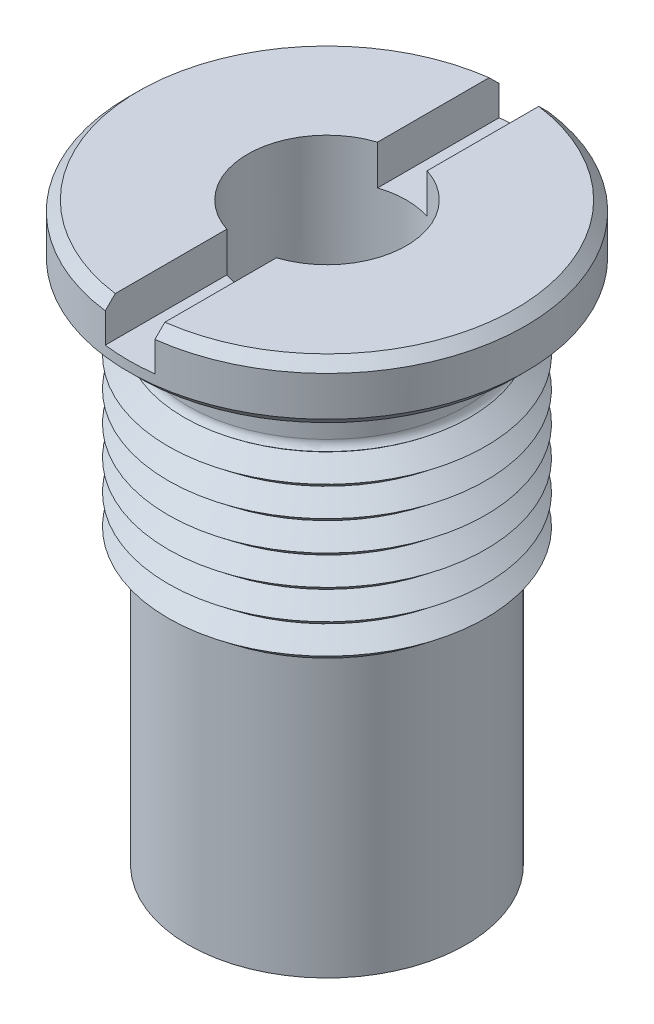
ISO-10303-21;
HEADER;
FILE_DESCRIPTION(('STEP AP214'),'2;1');
FILE_NAME('part.step','',(''),(''),'','','');
FILE_SCHEMA(('AUTOMOTIVE_DESIGN { 1 0 10303 214 1 1 1 1 }'));
ENDSEC;
DATA;
#1=APPLICATION_CONTEXT('core data for automotive mechanical design processes');
#2=APPLICATION_PROTOCOL_DEFINITION('international standard','automotive_design',2000,#1);
#3=PRODUCT_CONTEXT('',#1,'mechanical');
#4=PRODUCT('Part','Part','',(#3));
#5=PRODUCT_RELATED_PRODUCT_CATEGORY('part','',(#4));
#6=PRODUCT_DEFINITION_FORMATION('','',#4);
#7=PRODUCT_DEFINITION_CONTEXT('part definition',#1,'design');
#8=PRODUCT_DEFINITION('design','',#6,#7);
#9=PRODUCT_DEFINITION_SHAPE('','',#8);
#10=(LENGTH_UNIT() NAMED_UNIT(*) SI_UNIT(.MILLI.,.METRE.));
#11=(NAMED_UNIT(*) PLANE_ANGLE_UNIT() SI_UNIT($,.RADIAN.));
#12=(NAMED_UNIT(*) SI_UNIT($,.STERADIAN.) SOLID_ANGLE_UNIT());
#13=UNCERTAINTY_MEASURE_WITH_UNIT(LENGTH_MEASURE(1.E-05),#10,'distance_accuracy_value','');
#14=(GEOMETRIC_REPRESENTATION_CONTEXT(3) GLOBAL_UNCERTAINTY_ASSIGNED_CONTEXT((#13)) GLOBAL_UNIT_ASSIGNED_CONTEXT((#10,
#11,#12)) REPRESENTATION_CONTEXT('',''));
#15=CARTESIAN_POINT('',(0.,0.,0.));
#16=DIRECTION('',(0.,0.,1.));
#17=DIRECTION('',(1.,0.,0.));
#18=AXIS2_PLACEMENT_3D('',#15,#16,#17);
#19=CARTESIAN_POINT('',(0.,0.,0.));
#20=DIRECTION('',(0.,-1.,0.));
#21=DIRECTION('',(0.,0.,-1.));
#22=AXIS2_PLACEMENT_3D('',#19,#20,#21);
#23=CYLINDRICAL_SURFACE('',#22,3.);
#24=CARTESIAN_POINT('',(-2.22377190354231,11.5,2.01366296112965));
#25=CARTESIAN_POINT('',(-2.22377168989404,11.4443233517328,2.01366387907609));
#26=CARTESIAN_POINT('',(-2.2206378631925,11.3886379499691,2.01714052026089));
#27=CARTESIAN_POINT('',(-2.2080831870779,11.2788222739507,2.03087502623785));
#28=CARTESIAN_POINT('',(-2.19866069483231,11.2246924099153,2.0411346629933));
#29=CARTESIAN_POINT('',(-2.17348413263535,11.1195162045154,2.0679223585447));
#30=CARTESIAN_POINT('',(-2.1577275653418,11.0684710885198,2.08445288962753));
#31=CARTESIAN_POINT('',(-2.11986325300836,10.9709864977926,2.12294735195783));
#32=CARTESIAN_POINT('',(-2.09775583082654,10.9245467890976,2.14491100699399));
#33=CARTESIAN_POINT('',(-2.04756229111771,10.8382260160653,2.19286929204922));
#34=CARTESIAN_POINT('',(-2.01955078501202,10.7982732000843,2.21881260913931));
#35=CARTESIAN_POINT('',(-1.95763982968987,10.7255716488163,2.27362045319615));
#36=CARTESIAN_POINT('',(-1.92374176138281,10.6928212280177,2.30248429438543));
#37=CARTESIAN_POINT('',(-1.85214158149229,10.636909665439,2.36042350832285));
#38=CARTESIAN_POINT('',(-1.81466249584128,10.6134000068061,2.38943770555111));
#39=CARTESIAN_POINT('',(-1.73556937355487,10.5749107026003,2.44748835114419));
#40=CARTESIAN_POINT('',(-1.69395695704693,10.559927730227,2.47652478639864));
#41=CARTESIAN_POINT('',(-1.61012119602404,10.5396482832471,2.5317758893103));
#42=CARTESIAN_POINT('',(-1.56806088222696,10.5338589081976,2.55805765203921));
#43=CARTESIAN_POINT('',(-1.48244074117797,10.5306062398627,2.60860856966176));
#44=CARTESIAN_POINT('',(-1.43888122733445,10.5331412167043,2.63287814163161));
#45=CARTESIAN_POINT('',(-1.35291425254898,10.5462413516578,2.67804268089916));
#46=CARTESIAN_POINT('',(-1.31051110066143,10.5565651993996,2.69901660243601));
#47=CARTESIAN_POINT('',(-1.22683779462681,10.5846092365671,2.73806538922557));
#48=CARTESIAN_POINT('',(-1.18556768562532,10.6023297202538,2.75614013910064));
#49=CARTESIAN_POINT('',(-1.10471969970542,10.6449629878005,2.78954145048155));
#50=CARTESIAN_POINT('',(-1.06518185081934,10.6699914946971,2.80481679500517));
#51=CARTESIAN_POINT('',(-0.989720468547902,10.7263633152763,2.83232578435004));
#52=CARTESIAN_POINT('',(-0.953797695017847,10.7577079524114,2.84455879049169));
#53=CARTESIAN_POINT('',(-0.884912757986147,10.8275416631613,2.86675867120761));
#54=CARTESIAN_POINT('',(-0.852185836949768,10.8663080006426,2.87658303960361));
#55=CARTESIAN_POINT('',(-0.792795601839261,10.9487644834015,2.8935154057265));
#56=CARTESIAN_POINT('',(-0.766133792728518,10.9924558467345,2.90062272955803));
#57=CARTESIAN_POINT('',(-0.718459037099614,11.0859205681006,2.9128087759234));
#58=CARTESIAN_POINT('',(-0.697798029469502,11.1358893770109,2.9177673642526));
#59=CARTESIAN_POINT('',(-0.664630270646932,11.2386246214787,2.92550133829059));
#60=CARTESIAN_POINT('',(-0.652124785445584,11.291391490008,2.92827638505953));
#61=CARTESIAN_POINT('',(-0.635419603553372,11.3997691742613,2.93194797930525));
#62=CARTESIAN_POINT('',(-0.631455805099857,11.4554183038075,2.93279121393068));
#63=CARTESIAN_POINT('',(-0.632658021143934,11.566615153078,2.93253198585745));
#64=CARTESIAN_POINT('',(-0.637824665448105,11.6221628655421,2.93142938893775));
#65=CARTESIAN_POINT('',(-0.657189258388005,11.7319546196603,2.92714884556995));
#66=CARTESIAN_POINT('',(-0.671445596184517,11.7861878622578,2.92395747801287));
#67=CARTESIAN_POINT('',(-0.708589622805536,11.8914139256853,2.91517797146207));
#68=CARTESIAN_POINT('',(-0.731477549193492,11.942406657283,2.90958976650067));
#69=CARTESIAN_POINT('',(-0.784966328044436,12.0393231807,2.89561462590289));
#70=CARTESIAN_POINT('',(-0.815516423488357,12.0852775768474,2.88724599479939));
#71=CARTESIAN_POINT('',(-0.883388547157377,12.17106923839,2.86720636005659));
#72=CARTESIAN_POINT('',(-0.920709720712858,12.2109072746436,2.85553577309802));
#73=CARTESIAN_POINT('',(-0.999644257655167,12.282074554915,2.82885006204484));
#74=CARTESIAN_POINT('',(-1.04109988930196,12.3136188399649,2.81394290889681));
#75=CARTESIAN_POINT('',(-1.12771016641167,12.3685860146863,2.78036338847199));
#76=CARTESIAN_POINT('',(-1.17286345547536,12.3920118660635,2.76169239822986));
#77=CARTESIAN_POINT('',(-1.26271846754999,12.4288371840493,2.72173245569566));
#78=CARTESIAN_POINT('',(-1.30731354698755,12.4427086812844,2.70063864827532));
#79=CARTESIAN_POINT('',(-1.39682029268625,12.4618800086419,2.65544762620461));
#80=CARTESIAN_POINT('',(-1.44173185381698,12.4671825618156,2.63135136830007));
#81=CARTESIAN_POINT('',(-1.52832638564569,12.468977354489,2.58197380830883));
#82=CARTESIAN_POINT('',(-1.57006252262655,12.4658665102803,2.55679917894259));
#83=CARTESIAN_POINT('',(-1.65130470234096,12.4517846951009,2.50509702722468));
#84=CARTESIAN_POINT('',(-1.69081089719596,12.4408142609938,2.47856959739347));
#85=CARTESIAN_POINT('',(-1.76643645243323,12.4114604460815,2.4252494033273));
#86=CARTESIAN_POINT('',(-1.80257159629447,12.3931139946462,2.3984586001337));
#87=CARTESIAN_POINT('',(-1.87096696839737,12.3495905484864,2.34549696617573));
#88=CARTESIAN_POINT('',(-1.90322666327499,12.3244126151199,2.31932622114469));
#89=CARTESIAN_POINT('',(-1.96453181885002,12.2668893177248,2.26766044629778));
#90=CARTESIAN_POINT('',(-1.9934094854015,12.2343088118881,2.24222844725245));
#91=CARTESIAN_POINT('',(-2.04617286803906,12.1635130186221,2.19418614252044));
#92=CARTESIAN_POINT('',(-2.07005712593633,12.1252960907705,2.17157666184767));
#93=CARTESIAN_POINT('',(-2.1138493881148,12.04203815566,2.12899645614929));
#94=CARTESIAN_POINT('',(-2.13347149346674,11.9967394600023,2.1092353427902));
#95=CARTESIAN_POINT('',(-2.16696912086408,11.9022570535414,2.07480702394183));
#96=CARTESIAN_POINT('',(-2.18084465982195,11.8530733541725,2.06013980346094));
#97=CARTESIAN_POINT('',(-2.20251032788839,11.7537833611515,2.0369566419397));
#98=CARTESIAN_POINT('',(-2.21048595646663,11.7037609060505,2.02825389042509));
#99=CARTESIAN_POINT('',(-2.22111704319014,11.6024948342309,2.01660641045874));
#100=CARTESIAN_POINT('',(-2.22377210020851,11.5512511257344,2.01366211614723));
#101=CARTESIAN_POINT('',(-2.22377190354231,11.5,2.01366296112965));
#102=B_SPLINE_CURVE_WITH_KNOTS('',3,(#24,#25,#26,#27,#28,#29,#30,#31,#32,#33,#34,#35,#36,#37,
#38,#39,#40,#41,#42,#43,#44,#45,#46,#47,#48,#49,#50,#51,#52,#53,#54,#55,#56,#57,#58,#59,#60,#61,
#62,#63,#64,#65,#66,#67,#68,#69,#70,#71,#72,#73,#74,#75,#76,#77,#78,#79,#80,#81,#82,#83,#84,#85,
#86,#87,#88,#89,#90,#91,#92,#93,#94,#95,#96,#97,#98,#99,#100,#101),.UNSPECIFIED.,.T.,.F.,(4,2,2,
2,2,2,2,2,2,2,2,2,2,2,2,2,2,2,2,2,2,2,2,2,2,2,2,2,2,2,2,2,2,2,2,2,2,2,4),(0.,0.166849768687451,
0.333743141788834,0.500702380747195,0.667653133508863,0.832608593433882,0.997525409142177,
1.155430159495,1.31327325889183,1.46232750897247,1.6113507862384,1.75593754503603,
1.90053005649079,2.04754939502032,2.19459957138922,2.34894389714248,2.50332647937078,
2.66548088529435,2.82766045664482,2.99426446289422,3.16087996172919,3.32857667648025,
3.49627800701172,3.66289648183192,3.82949394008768,3.99121187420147,4.15287074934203,
4.3058234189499,4.45872747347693,4.60454534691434,4.75035326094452,4.89544007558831,
5.04054683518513,5.19114381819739,5.34178471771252,5.50059546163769,5.6594057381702,
5.81298168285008,5.96656920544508),.UNSPECIFIED.);
#103=CARTESIAN_POINT('',(-2.22377190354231,11.5,2.01366296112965));
#104=VERTEX_POINT('',#103);
#105=EDGE_CURVE('E189',#104,#104,#102,.T.);
#106=ORIENTED_EDGE('',*,*,#105,.T.);
#107=EDGE_LOOP('',(#106));
#108=FACE_BOUND('',#107,.T.);
#109=CARTESIAN_POINT('',(0.,16.,0.));
#110=DIRECTION('',(0.,-1.,0.));
#111=DIRECTION('',(0.,0.,-1.));
#112=AXIS2_PLACEMENT_3D('',#109,#110,#111);
#113=CIRCLE('',#112,3.);
#114=CARTESIAN_POINT('',(0.,16.,-3.));
#115=VERTEX_POINT('',#114);
#116=EDGE_CURVE('E307',#115,#115,#113,.T.);
#117=ORIENTED_EDGE('',*,*,#116,.F.);
#118=EDGE_LOOP('',(#117));
#119=FACE_BOUND('',#118,.T.);
#120=CARTESIAN_POINT('',(0.,0.,0.));
#121=DIRECTION('',(0.,-1.,0.));
#122=DIRECTION('',(0.,0.,-1.));
#123=AXIS2_PLACEMENT_3D('',#120,#121,#122);
#124=CIRCLE('',#123,3.);
#125=CARTESIAN_POINT('',(0.,0.,-3.));
#126=VERTEX_POINT('',#125);
#127=EDGE_CURVE('E311',#126,#126,#124,.T.);
#128=ORIENTED_EDGE('',*,*,#127,.T.);
#129=EDGE_LOOP('',(#128));
#130=FACE_BOUND('',#129,.T.);
#131=CARTESIAN_POINT('',(2.8557692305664,11.5,0.91901148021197));
#132=CARTESIAN_POINT('',(2.85576991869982,11.4443233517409,0.919010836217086));
#133=CARTESIAN_POINT('',(2.85721386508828,11.3886379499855,0.914558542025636));
#134=CARTESIAN_POINT('',(2.86283095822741,11.2788222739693,0.896818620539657));
#135=CARTESIAN_POINT('',(2.86700481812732,11.2246924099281,0.883528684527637));
#136=CARTESIAN_POINT('',(2.87761536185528,11.1195162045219,0.848331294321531));
#137=CARTESIAN_POINT('',(2.88405293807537,11.0684710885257,0.826420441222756));
#138=CARTESIAN_POINT('',(2.89845796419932,10.970986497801,0.774381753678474));
#139=CARTESIAN_POINT('',(2.90642533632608,10.9245467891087,0.744254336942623));
#140=CARTESIAN_POINT('',(2.92286165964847,10.8382260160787,0.676806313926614));
#141=CARTESIAN_POINT('',(2.93132347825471,10.7982732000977,0.639575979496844));
#142=CARTESIAN_POINT('',(2.9478329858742,10.7255716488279,0.558555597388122));
#143=CARTESIAN_POINT('',(2.95588077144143,10.6928212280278,0.514767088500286));
#144=CARTESIAN_POINT('',(2.97025751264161,10.6369096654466,0.423789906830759));
#145=CARTESIAN_POINT('',(2.97664500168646,10.6134000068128,0.376824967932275));
#146=CARTESIAN_POINT('',(2.98737177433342,10.5749107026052,0.279302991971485));
#147=CARTESIAN_POINT('',(2.99171185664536,10.559927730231,0.228747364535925));
#148=CARTESIAN_POINT('',(2.997642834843,10.5396482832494,0.128517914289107));
#149=CARTESIAN_POINT('',(2.99937335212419,10.533858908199,0.0789517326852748));
#150=CARTESIAN_POINT('',(3.00034166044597,10.5306062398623,-0.0204729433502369));
#151=CARTESIAN_POINT('',(2.99957996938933,10.5331412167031,-0.0703313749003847));
#152=CARTESIAN_POINT('',(2.99571012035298,10.546241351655,-0.167363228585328));
#153=CARTESIAN_POINT('',(2.99267249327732,10.556565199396,-0.21457239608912));
#154=CARTESIAN_POINT('',(2.98465308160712,10.584609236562,-0.306559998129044));
#155=CARTESIAN_POINT('',(2.97967121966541,10.6023297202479,-0.351338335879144));
#156=CARTESIAN_POINT('',(2.96817361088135,10.6449629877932,-0.438055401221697));
#157=CARTESIAN_POINT('',(2.96163352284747,10.669991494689,-0.479933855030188));
#158=CARTESIAN_POINT('',(2.94772631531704,10.7263633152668,-0.559039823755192));
#159=CARTESIAN_POINT('',(2.94035902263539,10.7577079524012,-0.596266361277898));
#160=CARTESIAN_POINT('',(2.92514221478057,10.8275416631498,-0.667022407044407));
#161=CARTESIAN_POINT('',(2.91728690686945,10.8663080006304,-0.70027693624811));
#162=CARTESIAN_POINT('',(2.9022556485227,10.9487644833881,-0.760176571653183));
#163=CARTESIAN_POINT('',(2.89507986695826,10.9924558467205,-0.786820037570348));
#164=CARTESIAN_POINT('',(2.88179591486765,11.0859205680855,-0.834200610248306));
#165=CARTESIAN_POINT('',(2.87575967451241,11.1358893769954,-0.854572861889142));
#166=CARTESIAN_POINT('',(2.86587361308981,11.2386246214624,-0.887163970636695));
#167=CARTESIAN_POINT('',(2.86202413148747,11.2913914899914,-0.899381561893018));
#168=CARTESIAN_POINT('',(2.85685123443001,11.3997691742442,-0.915684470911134));
#169=CARTESIAN_POINT('',(2.85559959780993,11.4554183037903,-0.919538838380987));
#170=CARTESIAN_POINT('',(2.85597620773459,11.5666151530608,-0.918368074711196));
#171=CARTESIAN_POINT('',(2.85760465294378,11.6221628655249,-0.913342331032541));
#172=CARTESIAN_POINT('',(2.86357989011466,11.7319546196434,-0.894431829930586));
#173=CARTESIAN_POINT('',(2.8679442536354,11.7861878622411,-0.880489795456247));
#174=CARTESIAN_POINT('',(2.87891299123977,11.8914139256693,-0.843932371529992));
#175=CARTESIAN_POINT('',(2.88551742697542,11.9424066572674,-0.82131674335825));
#176=CARTESIAN_POINT('',(2.90015898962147,12.0393231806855,-0.768006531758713));
#177=CARTESIAN_POINT('',(2.9081865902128,12.0852775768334,-0.737365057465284));
#178=CARTESIAN_POINT('',(2.92476781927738,12.1710692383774,-0.668566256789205));
#179=CARTESIAN_POINT('',(2.93332138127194,12.2109072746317,-0.630409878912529));
#180=CARTESIAN_POINT('',(2.94967814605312,12.2820745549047,-0.548707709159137));
#181=CARTESIAN_POINT('',(2.95749598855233,12.3136188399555,-0.505352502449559));
#182=CARTESIAN_POINT('',(2.97172040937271,12.3685860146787,-0.41355604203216));
#183=CARTESIAN_POINT('',(2.97812750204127,12.3920118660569,-0.365116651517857));
#184=CARTESIAN_POINT('',(2.98844868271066,12.4288371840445,-0.267319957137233));
#185=CARTESIAN_POINT('',(2.99247844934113,12.4427086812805,-0.218152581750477));
#186=CARTESIAN_POINT('',(2.99809524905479,12.4618800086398,-0.118041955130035));
#187=CARTESIAN_POINT('',(2.99968305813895,12.4671825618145,-0.0670992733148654));
#188=CARTESIAN_POINT('',(3.00021810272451,12.4689773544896,0.0325825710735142));
#189=CARTESIAN_POINT('',(2.99928430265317,12.4658665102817,0.0813144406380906));
#190=CARTESIAN_POINT('',(2.9951300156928,12.4517846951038,0.17752330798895));
#191=CARTESIAN_POINT('',(2.99190968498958,12.4408142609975,0.225000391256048));
#192=CARTESIAN_POINT('',(2.98354582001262,12.4114604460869,0.317154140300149));
#193=CARTESIAN_POINT('',(2.97841187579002,12.3931139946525,0.361843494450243));
#194=CARTESIAN_POINT('',(2.96674344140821,12.3495905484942,0.447556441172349));
#195=CARTESIAN_POINT('',(2.96020875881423,12.3244126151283,0.488579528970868));
#196=CARTESIAN_POINT('',(2.94611746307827,12.2668893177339,0.567504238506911));
#197=CARTESIAN_POINT('',(2.93853153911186,12.2343088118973,0.605229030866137));
#198=CARTESIAN_POINT('',(2.92330737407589,12.1635130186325,0.674944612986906));
#199=CARTESIAN_POINT('',(2.91566911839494,12.1252960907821,0.706933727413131));
#200=CARTESIAN_POINT('',(2.90068970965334,12.0420381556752,0.766149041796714));
#201=CARTESIAN_POINT('',(2.89338713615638,11.99673946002,0.793022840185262));
#202=CARTESIAN_POINT('',(2.88032015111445,11.9022570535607,0.83924679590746));
#203=CARTESIAN_POINT('',(2.87455573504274,11.8530733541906,0.858596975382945));
#204=CARTESIAN_POINT('',(2.8653113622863,11.7537833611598,0.888951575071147));
#205=CARTESIAN_POINT('',(2.86176237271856,11.70376090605,0.900210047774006));
#206=CARTESIAN_POINT('',(2.85699090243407,11.6024948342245,0.915240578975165));
#207=CARTESIAN_POINT('',(2.85576859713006,11.5512511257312,0.919012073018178));
#208=CARTESIAN_POINT('',(2.8557692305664,11.5,0.91901148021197));
#209=B_SPLINE_CURVE_WITH_KNOTS('',3,(#131,#132,#133,#134,#135,#136,#137,#138,#139,#140,#141,
#142,#143,#144,#145,#146,#147,#148,#149,#150,#151,#152,#153,#154,#155,#156,#157,#158,#159,#160,
#161,#162,#163,#164,#165,#166,#167,#168,#169,#170,#171,#172,#173,#174,#175,#176,#177,#178,#179,
#180,#181,#182,#183,#184,#185,#186,#187,#188,#189,#190,#191,#192,#193,#194,#195,#196,#197,#198,
#199,#200,#201,#202,#203,#204,#205,#206,#207,#208),.UNSPECIFIED.,.T.,.F.,(4,2,2,2,2,2,2,2,2,2,2,
2,2,2,2,2,2,2,2,2,2,2,2,2,2,2,2,2,2,2,2,2,2,2,2,2,2,2,4),(0.,0.166849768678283,
0.333743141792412,0.500702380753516,0.667653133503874,0.832608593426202,0.997525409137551,
1.15543015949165,1.31327325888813,1.46232750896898,1.61135078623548,1.75593754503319,
1.90053005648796,2.0475493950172,2.19459957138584,2.34894389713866,2.50332647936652,
2.66548088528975,2.82766045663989,2.99426446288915,3.160879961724,3.32857667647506,
3.49627800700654,3.66289648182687,3.82949394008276,3.99121187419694,4.15287074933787,
4.30582341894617,4.45872747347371,4.60454534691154,4.75035326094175,4.89544007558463,
5.04054683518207,5.19114381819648,5.34178471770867,5.50059546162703,5.65940573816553,
5.81298168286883,5.96656920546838),.UNSPECIFIED.);
#210=CARTESIAN_POINT('',(2.8557692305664,11.5,0.91901148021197));
#211=VERTEX_POINT('',#210);
#212=EDGE_CURVE('E182',#211,#211,#209,.T.);
#213=ORIENTED_EDGE('',*,*,#212,.T.);
#214=EDGE_LOOP('',(#213));
#215=FACE_BOUND('',#214,.T.);
#216=CARTESIAN_POINT('',(-2.22377190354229,11.5,-2.01366296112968));
#217=CARTESIAN_POINT('',(-2.22377168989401,11.5556766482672,-2.01366387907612));
#218=CARTESIAN_POINT('',(-2.22063786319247,11.6113620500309,-2.01714052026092));
#219=CARTESIAN_POINT('',(-2.20808318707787,11.7211777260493,-2.03087502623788));
#220=CARTESIAN_POINT('',(-2.19866069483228,11.7753075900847,-2.04113466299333));
#221=CARTESIAN_POINT('',(-2.17348413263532,11.8804837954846,-2.06792235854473));
#222=CARTESIAN_POINT('',(-2.15772756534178,11.9315289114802,-2.08445288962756));
#223=CARTESIAN_POINT('',(-2.11986325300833,12.0290135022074,-2.12294735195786));
#224=CARTESIAN_POINT('',(-2.09775583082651,12.0754532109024,-2.14491100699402));
#225=CARTESIAN_POINT('',(-2.04756229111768,12.1617739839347,-2.19286929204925));
#226=CARTESIAN_POINT('',(-2.01955078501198,12.2017267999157,-2.21881260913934));
#227=CARTESIAN_POINT('',(-1.95763982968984,12.2744283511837,-2.27362045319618));
#228=CARTESIAN_POINT('',(-1.92374176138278,12.3071787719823,-2.30248429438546));
#229=CARTESIAN_POINT('',(-1.85214158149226,12.363090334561,-2.36042350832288));
#230=CARTESIAN_POINT('',(-1.81466249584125,12.3865999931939,-2.38943770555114));
#231=CARTESIAN_POINT('',(-1.73556937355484,12.4250892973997,-2.44748835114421));
#232=CARTESIAN_POINT('',(-1.6939569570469,12.440072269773,-2.47652478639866));
#233=CARTESIAN_POINT('',(-1.61012119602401,12.4603517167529,-2.53177588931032));
#234=CARTESIAN_POINT('',(-1.56806088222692,12.4661410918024,-2.55805765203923));
#235=CARTESIAN_POINT('',(-1.48244074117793,12.4693937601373,-2.60860856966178));
#236=CARTESIAN_POINT('',(-1.43888122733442,12.4668587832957,-2.63287814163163));
#237=CARTESIAN_POINT('',(-1.35291425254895,12.4537586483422,-2.67804268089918));
#238=CARTESIAN_POINT('',(-1.3105111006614,12.4434348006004,-2.69901660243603));
#239=CARTESIAN_POINT('',(-1.22683779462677,12.4153907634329,-2.73806538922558));
#240=CARTESIAN_POINT('',(-1.18556768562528,12.3976702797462,-2.75614013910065));
#241=CARTESIAN_POINT('',(-1.10471969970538,12.3550370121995,-2.78954145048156));
#242=CARTESIAN_POINT('',(-1.06518185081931,12.3300085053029,-2.80481679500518));
#243=CARTESIAN_POINT('',(-0.989720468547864,12.2736366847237,-2.83232578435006));
#244=CARTESIAN_POINT('',(-0.953797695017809,12.2422920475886,-2.8445587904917));
#245=CARTESIAN_POINT('',(-0.884912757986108,12.1724583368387,-2.86675867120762));
#246=CARTESIAN_POINT('',(-0.852185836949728,12.1336919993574,-2.87658303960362));
#247=CARTESIAN_POINT('',(-0.792795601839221,12.0512355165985,-2.89351540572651));
#248=CARTESIAN_POINT('',(-0.766133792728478,12.0075441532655,-2.90062272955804));
#249=CARTESIAN_POINT('',(-0.718459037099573,11.9140794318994,-2.91280877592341));
#250=CARTESIAN_POINT('',(-0.697798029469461,11.8641106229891,-2.91776736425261));
#251=CARTESIAN_POINT('',(-0.664630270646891,11.7613753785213,-2.9255013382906));
#252=CARTESIAN_POINT('',(-0.652124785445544,11.708608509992,-2.92827638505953));
#253=CARTESIAN_POINT('',(-0.635419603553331,11.6002308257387,-2.93194797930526));
#254=CARTESIAN_POINT('',(-0.631455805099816,11.5445816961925,-2.93279121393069));
#255=CARTESIAN_POINT('',(-0.632658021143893,11.433384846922,-2.93253198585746));
#256=CARTESIAN_POINT('',(-0.637824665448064,11.3778371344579,-2.93142938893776));
#257=CARTESIAN_POINT('',(-0.657189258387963,11.2680453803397,-2.92714884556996));
#258=CARTESIAN_POINT('',(-0.671445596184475,11.2138121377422,-2.92395747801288));
#259=CARTESIAN_POINT('',(-0.708589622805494,11.1085860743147,-2.91517797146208));
#260=CARTESIAN_POINT('',(-0.73147754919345,11.057593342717,-2.90958976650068));
#261=CARTESIAN_POINT('',(-0.784966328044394,10.9606768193,-2.8956146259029));
#262=CARTESIAN_POINT('',(-0.815516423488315,10.9147224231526,-2.8872459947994));
#263=CARTESIAN_POINT('',(-0.883388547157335,10.82893076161,-2.8672063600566));
#264=CARTESIAN_POINT('',(-0.920709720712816,10.7890927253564,-2.85553577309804));
#265=CARTESIAN_POINT('',(-0.999644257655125,10.717925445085,-2.82885006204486));
#266=CARTESIAN_POINT('',(-1.04109988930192,10.6863811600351,-2.81394290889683));
#267=CARTESIAN_POINT('',(-1.12771016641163,10.6314139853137,-2.78036338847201));
#268=CARTESIAN_POINT('',(-1.17286345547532,10.6079881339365,-2.76169239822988));
#269=CARTESIAN_POINT('',(-1.26271846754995,10.5711628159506,-2.72173245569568));
#270=CARTESIAN_POINT('',(-1.30731354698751,10.5572913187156,-2.70063864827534));
#271=CARTESIAN_POINT('',(-1.39682029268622,10.5381199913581,-2.65544762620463));
#272=CARTESIAN_POINT('',(-1.44173185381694,10.5328174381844,-2.63135136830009));
#273=CARTESIAN_POINT('',(-1.52832638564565,10.531022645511,-2.58197380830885));
#274=CARTESIAN_POINT('',(-1.57006252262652,10.5341334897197,-2.55679917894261));
#275=CARTESIAN_POINT('',(-1.65130470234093,10.5482153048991,-2.50509702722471));
#276=CARTESIAN_POINT('',(-1.69081089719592,10.5591857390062,-2.47856959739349));
#277=CARTESIAN_POINT('',(-1.76643645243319,10.5885395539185,-2.42524940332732));
#278=CARTESIAN_POINT('',(-1.80257159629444,10.6068860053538,-2.39845860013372));
#279=CARTESIAN_POINT('',(-1.87096696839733,10.6504094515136,-2.34549696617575));
#280=CARTESIAN_POINT('',(-1.90322666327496,10.6755873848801,-2.31932622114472));
#281=CARTESIAN_POINT('',(-1.96453181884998,10.7331106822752,-2.26766044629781));
#282=CARTESIAN_POINT('',(-1.99340948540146,10.7656911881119,-2.24222844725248));
#283=CARTESIAN_POINT('',(-2.04617286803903,10.8364869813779,-2.19418614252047));
#284=CARTESIAN_POINT('',(-2.0700571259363,10.8747039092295,-2.1715766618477));
#285=CARTESIAN_POINT('',(-2.11384938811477,10.95796184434,-2.12899645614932));
#286=CARTESIAN_POINT('',(-2.13347149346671,11.0032605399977,-2.10923534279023));
#287=CARTESIAN_POINT('',(-2.16696912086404,11.0977429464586,-2.07480702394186));
#288=CARTESIAN_POINT('',(-2.18084465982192,11.1469266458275,-2.06013980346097));
#289=CARTESIAN_POINT('',(-2.20251032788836,11.2462166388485,-2.03695664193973));
#290=CARTESIAN_POINT('',(-2.21048595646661,11.2962390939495,-2.02825389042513));
#291=CARTESIAN_POINT('',(-2.22111704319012,11.3975051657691,-2.01660641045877));
#292=CARTESIAN_POINT('',(-2.22377210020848,11.4487488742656,-2.01366211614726));
#293=CARTESIAN_POINT('',(-2.22377190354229,11.5,-2.01366296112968));
#294=B_SPLINE_CURVE_WITH_KNOTS('',3,(#216,#217,#218,#219,#220,#221,#222,#223,#224,#225,#226,
#227,#228,#229,#230,#231,#232,#233,#234,#235,#236,#237,#238,#239,#240,#241,#242,#243,#244,#245,
#246,#247,#248,#249,#250,#251,#252,#253,#254,#255,#256,#257,#258,#259,#260,#261,#262,#263,#264,
#265,#266,#267,#268,#269,#270,#271,#272,#273,#274,#275,#276,#277,#278,#279,#280,#281,#282,#283,
#284,#285,#286,#287,#288,#289,#290,#291,#292,#293),.UNSPECIFIED.,.T.,.F.,(4,2,2,2,2,2,2,2,2,2,2,
2,2,2,2,2,2,2,2,2,2,2,2,2,2,2,2,2,2,2,2,2,2,2,2,2,2,2,4),(0.,0.166849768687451,
0.333743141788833,0.500702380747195,0.667653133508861,0.832608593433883,0.997525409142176,
1.155430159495,1.31327325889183,1.46232750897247,1.6113507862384,1.75593754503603,
1.90053005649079,2.04754939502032,2.19459957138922,2.34894389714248,2.50332647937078,
2.66548088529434,2.82766045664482,2.99426446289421,3.16087996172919,3.32857667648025,
3.49627800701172,3.66289648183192,3.82949394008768,3.99121187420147,4.15287074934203,
4.3058234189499,4.45872747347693,4.60454534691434,4.75035326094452,4.89544007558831,
5.04054683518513,5.1911438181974,5.34178471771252,5.50059546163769,5.6594057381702,
5.81298168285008,5.96656920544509),.UNSPECIFIED.);
#295=CARTESIAN_POINT('',(-2.22377190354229,11.5,-2.01366296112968));
#296=VERTEX_POINT('',#295);
#297=EDGE_CURVE('E43',#296,#296,#294,.T.);
#298=ORIENTED_EDGE('',*,*,#297,.T.);
#299=EDGE_LOOP('',(#298));
#300=FACE_BOUND('',#299,.T.);
#301=ADVANCED_FACE('F39',(#108,#119,#130,#215,#300),#23,.F.);
#302=CARTESIAN_POINT('',(9.5,29.,0.));
#303=DIRECTION('',(0.,1.,0.));
#304=DIRECTION('',(0.,0.,1.));
#305=AXIS2_PLACEMENT_3D('',#302,#303,#304);
#306=PLANE('',#305);
#307=DIRECTION('',(0.,0.,-1.));
#308=VECTOR('',#307,1.);
#309=CARTESIAN_POINT('',(1.25,29.,-10.));
#310=LINE('',#309,#308);
#311=CARTESIAN_POINT('',(1.25,29.,9.41740410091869));
#312=VERTEX_POINT('',#311);
#313=CARTESIAN_POINT('',(1.25,29.,3.79967103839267));
#314=VERTEX_POINT('',#313);
#315=EDGE_CURVE('E125',#312,#314,#310,.T.);
#316=ORIENTED_EDGE('',*,*,#315,.F.);
#317=CARTESIAN_POINT('',(0.,29.,0.));
#318=DIRECTION('',(0.,-1.,0.));
#319=DIRECTION('',(0.,0.,-1.));
#320=AXIS2_PLACEMENT_3D('',#317,#318,#319);
#321=CIRCLE('',#320,9.5);
#322=CARTESIAN_POINT('',(1.25,29.,-9.41740410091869));
#323=VERTEX_POINT('',#322);
#324=EDGE_CURVE('E142',#323,#312,#321,.T.);
#325=ORIENTED_EDGE('',*,*,#324,.F.);
#326=CARTESIAN_POINT('',(1.25,29.,-3.79967103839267));
#327=VERTEX_POINT('',#326);
#328=EDGE_CURVE('E147',#327,#323,#310,.T.);
#329=ORIENTED_EDGE('',*,*,#328,.F.);
#330=CARTESIAN_POINT('',(0.,29.,0.));
#331=DIRECTION('',(0.,-1.,0.));
#332=DIRECTION('',(0.,0.,-1.));
#333=AXIS2_PLACEMENT_3D('',#330,#331,#332);
#334=CIRCLE('',#333,4.);
#335=EDGE_CURVE('E144',#327,#314,#334,.T.);
#336=ORIENTED_EDGE('',*,*,#335,.T.);
#337=EDGE_LOOP('',(#316,#325,#329,#336));
#338=FACE_BOUND('',#337,.T.);
#339=ADVANCED_FACE('F140',(#338),#306,.T.);
#340=CARTESIAN_POINT('',(0.,28.5,0.));
#341=DIRECTION('',(0.,-1.,0.));
#342=DIRECTION('',(0.,0.,-1.));
#343=AXIS2_PLACEMENT_3D('',#340,#341,#342);
#344=CONICAL_SURFACE('',#343,10.,0.785398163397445);
#345=CARTESIAN_POINT('',(1.25,16.4960505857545,21.9684157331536));
#346=CARTESIAN_POINT('',(1.25,17.2421602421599,21.2210901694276));
#347=CARTESIAN_POINT('',(1.25,17.9882169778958,20.473711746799));
#348=CARTESIAN_POINT('',(1.25,19.4801667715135,18.9787746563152));
#349=CARTESIAN_POINT('',(1.25,20.2260598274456,18.2312159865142));
#350=CARTESIAN_POINT('',(1.25,21.7177967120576,16.735671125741));
#351=CARTESIAN_POINT('',(1.25,22.4636404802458,15.9876848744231));
#352=CARTESIAN_POINT('',(1.25,23.954957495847,14.4913595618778));
#353=CARTESIAN_POINT('',(1.25,24.7004307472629,13.74302050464));
#354=CARTESIAN_POINT('',(1.25,26.2161683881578,12.220296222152));
#355=CARTESIAN_POINT('',(1.25,26.9864130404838,11.4458913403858));
#356=CARTESIAN_POINT('',(1.25,28.140959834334,10.2834427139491));
#357=CARTESIAN_POINT('',(1.25,28.5256787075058,9.89581291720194));
#358=CARTESIAN_POINT('',(1.25,29.2947170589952,9.120159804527));
#359=CARTESIAN_POINT('',(1.25,29.6790365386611,8.73213648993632));
#360=CARTESIAN_POINT('',(1.25,30.4470285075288,7.95557398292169));
#361=CARTESIAN_POINT('',(1.25,30.8307010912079,7.56703488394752));
#362=CARTESIAN_POINT('',(1.25,31.5971498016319,6.7890624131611));
#363=CARTESIAN_POINT('',(1.25,31.9799259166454,6.39962902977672));
#364=CARTESIAN_POINT('',(1.25,32.5529231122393,5.81435887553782));
#365=CARTESIAN_POINT('',(1.25,32.743722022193,5.61908797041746));
#366=CARTESIAN_POINT('',(1.25,33.1247912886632,5.22803127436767));
#367=CARTESIAN_POINT('',(1.25,33.3150616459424,5.03224548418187));
#368=CARTESIAN_POINT('',(1.25,33.6948613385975,4.63996412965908));
#369=CARTESIAN_POINT('',(1.25,33.8843906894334,4.44346858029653));
#370=CARTESIAN_POINT('',(1.25,34.2623790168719,4.04945121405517));
#371=CARTESIAN_POINT('',(1.25,34.4508380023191,3.85192940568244));
#372=CARTESIAN_POINT('',(1.25,34.6889470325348,3.60026614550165));
#373=CARTESIAN_POINT('',(1.25,34.7393682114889,3.54685423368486));
#374=CARTESIAN_POINT('',(1.25,34.8400711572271,3.43989895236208));
#375=CARTESIAN_POINT('',(1.25,34.8903529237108,3.38635558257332));
#376=CARTESIAN_POINT('',(1.25,35.0409626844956,3.22550182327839));
#377=CARTESIAN_POINT('',(1.25,35.1410537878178,3.11796921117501));
#378=CARTESIAN_POINT('',(1.25,35.3400587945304,2.90248701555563));
#379=CARTESIAN_POINT('',(1.25,35.438975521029,2.79454004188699));
#380=CARTESIAN_POINT('',(1.25,35.6356586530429,2.57760665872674));
#381=CARTESIAN_POINT('',(1.25,35.7334250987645,2.46862028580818));
#382=CARTESIAN_POINT('',(1.25,35.8952798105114,2.28544173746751));
#383=CARTESIAN_POINT('',(1.25,35.959822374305,2.21165142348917));
#384=CARTESIAN_POINT('',(1.25,36.0879394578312,2.06323604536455));
#385=CARTESIAN_POINT('',(1.25,36.1515139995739,1.98861100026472));
#386=CARTESIAN_POINT('',(1.25,36.2777642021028,1.83781002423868));
#387=CARTESIAN_POINT('',(1.25,36.3404318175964,1.76162733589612));
#388=CARTESIAN_POINT('',(1.25,36.4639588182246,1.60781444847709));
#389=CARTESIAN_POINT('',(1.25,36.5248183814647,1.53018439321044));
#390=CARTESIAN_POINT('',(1.25,36.6446952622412,1.3719917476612));
#391=CARTESIAN_POINT('',(1.25,36.7036806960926,1.29140482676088));
#392=CARTESIAN_POINT('',(1.25,36.8177749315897,1.12732851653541));
#393=CARTESIAN_POINT('',(1.25,36.8728784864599,1.04383541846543));
#394=CARTESIAN_POINT('',(1.25,36.9763927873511,0.873738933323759));
#395=CARTESIAN_POINT('',(1.25,37.024857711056,0.787169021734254));
#396=CARTESIAN_POINT('',(1.25,37.1116479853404,0.609111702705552));
#397=CARTESIAN_POINT('',(1.25,37.1500041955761,0.517640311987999));
#398=CARTESIAN_POINT('',(1.25,37.1939820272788,0.380566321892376));
#399=CARTESIAN_POINT('',(1.25,37.2060655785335,0.33704914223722));
#400=CARTESIAN_POINT('',(1.25,37.2261467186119,0.249068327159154));
#401=CARTESIAN_POINT('',(1.25,37.234144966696,0.20460484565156));
#402=CARTESIAN_POINT('',(1.25,37.2454659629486,0.115334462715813));
#403=CARTESIAN_POINT('',(1.25,37.2488153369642,0.0705310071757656));
#404=CARTESIAN_POINT('',(1.25,37.2506572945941,-0.0191781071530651));
#405=CARTESIAN_POINT('',(1.25,37.2491499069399,-0.0640837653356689));
#406=CARTESIAN_POINT('',(1.25,37.2414168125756,-0.153299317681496));
#407=CARTESIAN_POINT('',(1.25,37.2352096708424,-0.197610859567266));
#408=CARTESIAN_POINT('',(1.25,37.2185516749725,-0.285432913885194));
#409=CARTESIAN_POINT('',(1.25,37.208098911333,-0.328943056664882));
#410=CARTESIAN_POINT('',(1.25,37.1834936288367,-0.415227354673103));
#411=CARTESIAN_POINT('',(1.25,37.1693149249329,-0.45799392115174));
#412=CARTESIAN_POINT('',(1.25,37.13796013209,-0.542389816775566));
#413=CARTESIAN_POINT('',(1.25,37.1207844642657,-0.584019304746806));
#414=CARTESIAN_POINT('',(1.25,37.0708429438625,-0.69569297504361));
#415=CARTESIAN_POINT('',(1.25,37.0357357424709,-0.76468504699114));
#416=CARTESIAN_POINT('',(1.25,36.9607200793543,-0.900030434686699));
#417=CARTESIAN_POINT('',(1.25,36.9208064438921,-0.966380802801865));
#418=CARTESIAN_POINT('',(1.25,36.8375317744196,-1.09720130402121));
#419=CARTESIAN_POINT('',(1.25,36.7941587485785,-1.16166373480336));
#420=CARTESIAN_POINT('',(1.25,36.7050860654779,-1.2889049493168));
#421=CARTESIAN_POINT('',(1.25,36.6593873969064,-1.35168443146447));
#422=CARTESIAN_POINT('',(1.25,36.5658465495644,-1.47654096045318));
#423=CARTESIAN_POINT('',(1.25,36.5179882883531,-1.53860589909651));
#424=CARTESIAN_POINT('',(1.25,36.4209707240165,-1.66171500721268));
#425=CARTESIAN_POINT('',(1.25,36.3718113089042,-1.72275908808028));
#426=CARTESIAN_POINT('',(1.25,36.2726173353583,-1.84389226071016));
#427=CARTESIAN_POINT('',(1.25,36.2225850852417,-1.90398324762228));
#428=CARTESIAN_POINT('',(1.25,36.1217509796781,-2.02351044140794));
#429=CARTESIAN_POINT('',(1.25,36.0709491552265,-2.08294667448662));
#430=CARTESIAN_POINT('',(1.25,35.9197820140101,-2.25797618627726));
#431=CARTESIAN_POINT('',(1.25,35.8185547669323,-2.37282454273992));
#432=CARTESIAN_POINT('',(1.25,35.614550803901,-2.60113902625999));
#433=CARTESIAN_POINT('',(1.25,35.5117740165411,-2.71460508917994));
#434=CARTESIAN_POINT('',(1.25,35.3051169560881,-2.94055514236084));
#435=CARTESIAN_POINT('',(1.25,35.2012365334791,-3.05303899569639));
#436=CARTESIAN_POINT('',(1.25,34.9926798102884,-3.27726705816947));
#437=CARTESIAN_POINT('',(1.25,34.8880035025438,-3.38901126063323));
#438=CARTESIAN_POINT('',(1.25,34.5728426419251,-3.7236751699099));
#439=CARTESIAN_POINT('',(1.25,34.361471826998,-3.9457597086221));
#440=CARTESIAN_POINT('',(1.25,33.9373346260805,-4.3885530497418));
#441=CARTESIAN_POINT('',(1.25,33.7245683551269,-4.60926196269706));
#442=CARTESIAN_POINT('',(1.25,33.3002548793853,-5.04755696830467));
#443=CARTESIAN_POINT('',(1.25,33.0887170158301,-5.26515210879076));
#444=CARTESIAN_POINT('',(1.25,32.6650077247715,-5.69973308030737));
#445=CARTESIAN_POINT('',(1.25,32.4528362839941,-5.9167188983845));
#446=CARTESIAN_POINT('',(1.25,32.0281447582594,-6.35014034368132));
#447=CARTESIAN_POINT('',(1.25,31.8156248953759,-6.56657618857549));
#448=CARTESIAN_POINT('',(1.25,31.3902481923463,-6.99911352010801));
#449=CARTESIAN_POINT('',(1.25,31.1773913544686,-7.21521500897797));
#450=CARTESIAN_POINT('',(1.25,30.3700745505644,-8.0338874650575));
#451=CARTESIAN_POINT('',(1.25,29.7747642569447,-8.63561970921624));
#452=CARTESIAN_POINT('',(1.25,28.5831358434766,-9.83808832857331));
#453=CARTESIAN_POINT('',(1.25,27.9868177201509,-10.4388247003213));
#454=CARTESIAN_POINT('',(1.25,26.793446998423,-11.6398219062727));
#455=CARTESIAN_POINT('',(1.25,26.1963942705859,-12.2400826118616));
#456=CARTESIAN_POINT('',(1.25,25.0019029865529,-13.4402184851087));
#457=CARTESIAN_POINT('',(1.25,24.4044644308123,-14.0400936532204));
#458=CARTESIAN_POINT('',(1.25,23.197958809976,-15.2509889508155));
#459=CARTESIAN_POINT('',(1.25,22.5888866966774,-15.8620040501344));
#460=CARTESIAN_POINT('',(1.25,21.3705499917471,-17.0838427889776));
#461=CARTESIAN_POINT('',(1.25,20.761285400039,-17.6946664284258));
#462=CARTESIAN_POINT('',(1.25,19.5427522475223,-18.916037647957));
#463=CARTESIAN_POINT('',(1.25,18.9334837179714,-19.5265852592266));
#464=CARTESIAN_POINT('',(1.25,17.7148394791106,-20.7475729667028));
#465=CARTESIAN_POINT('',(1.25,17.1054637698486,-21.3580130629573));
#466=CARTESIAN_POINT('',(1.25,16.4960505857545,-21.9684157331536));
#467=B_SPLINE_CURVE_WITH_KNOTS('',3,(#345,#346,#347,#348,#349,#350,#351,#352,#353,#354,#355,
#356,#357,#358,#359,#360,#361,#362,#363,#364,#365,#366,#367,#368,#369,#370,#371,#372,#373,#374,
#375,#376,#377,#378,#379,#380,#381,#382,#383,#384,#385,#386,#387,#388,#389,#390,#391,#392,#393,
#394,#395,#396,#397,#398,#399,#400,#401,#402,#403,#404,#405,#406,#407,#408,#409,#410,#411,#412,
#413,#414,#415,#416,#417,#418,#419,#420,#421,#422,#423,#424,#425,#426,#427,#428,#429,#430,#431,
#432,#433,#434,#435,#436,#437,#438,#439,#440,#441,#442,#443,#444,#445,#446,#447,#448,#449,#450,
#451,#452,#453,#454,#455,#456,#457,#458,#459,#460,#461,#462,#463,#464,#465,#466),.UNSPECIFIED.,
.F.,.F.,(4,2,2,2,2,2,2,2,2,2,2,2,2,2,2,2,2,2,2,2,2,2,2,2,2,2,2,2,2,2,2,2,2,2,2,2,2,2,2,2,2,2,2,
2,2,2,2,2,2,2,2,2,2,2,2,2,2,2,2,2,4),(0.,3.16805558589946,6.33614705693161,9.50504222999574,
12.6739023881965,15.9506099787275,17.5890203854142,19.2274252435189,20.8655654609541,
22.5037269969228,23.3227590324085,24.1417898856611,24.9608035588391,25.7798104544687,
26.000164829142,26.2205196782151,26.6612352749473,27.1004720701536,27.5396934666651,
27.8337907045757,28.1278812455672,28.4238000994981,28.7196897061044,29.0192202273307,
29.3191481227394,29.6164603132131,29.9128540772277,30.048184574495,30.1834932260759,
30.3180236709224,30.452553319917,30.586554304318,30.7206156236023,30.8556455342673,
30.9906564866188,31.2225745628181,31.4547445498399,31.6877575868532,31.9206723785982,
32.1557713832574,32.3908906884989,32.6254616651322,32.860023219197,33.3192741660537,
33.7785463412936,34.2378815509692,34.6972208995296,35.6169868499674,36.5366779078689,
37.4470951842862,38.3575316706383,39.2675215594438,40.1775053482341,42.7168495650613,
45.2562025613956,47.7960966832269,50.3359878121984,52.9241868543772,55.5123869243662,
58.1000091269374,60.6876301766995),.UNSPECIFIED.);
#468=CARTESIAN_POINT('',(1.25,28.5,9.92156741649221));
#469=VERTEX_POINT('',#468);
#470=EDGE_CURVE('E122',#469,#312,#467,.T.);
#471=ORIENTED_EDGE('',*,*,#470,.F.);
#472=CARTESIAN_POINT('',(0.,28.5,0.));
#473=DIRECTION('',(0.,-1.,0.));
#474=DIRECTION('',(0.,0.,-1.));
#475=AXIS2_PLACEMENT_3D('',#472,#473,#474);
#476=CIRCLE('',#475,10.);
#477=CARTESIAN_POINT('',(1.25,28.5,-9.92156741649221));
#478=VERTEX_POINT('',#477);
#479=EDGE_CURVE('E164',#478,#469,#476,.T.);
#480=ORIENTED_EDGE('',*,*,#479,.F.);
#481=EDGE_CURVE('E136',#323,#478,#467,.T.);
#482=ORIENTED_EDGE('',*,*,#481,.F.);
#483=ORIENTED_EDGE('',*,*,#324,.T.);
#484=EDGE_LOOP('',(#471,#480,#482,#483));
#485=FACE_BOUND('',#484,.T.);
#486=ADVANCED_FACE('F150',(#485),#344,.T.);
#487=DIRECTION('',(0.,0.,1.));
#488=VECTOR('',#487,1.);
#489=CARTESIAN_POINT('',(-1.25,29.,-10.));
#490=LINE('',#489,#488);
#491=CARTESIAN_POINT('',(-1.25,29.,-9.41740410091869));
#492=VERTEX_POINT('',#491);
#493=CARTESIAN_POINT('',(-1.25,29.,-3.79967103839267));
#494=VERTEX_POINT('',#493);
#495=EDGE_CURVE('E377',#492,#494,#490,.T.);
#496=ORIENTED_EDGE('',*,*,#495,.F.);
#497=CARTESIAN_POINT('',(-1.25,29.,9.41740410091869));
#498=VERTEX_POINT('',#497);
#499=EDGE_CURVE('E153',#498,#492,#321,.T.);
#500=ORIENTED_EDGE('',*,*,#499,.F.);
#501=CARTESIAN_POINT('',(-1.25,29.,3.79967103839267));
#502=VERTEX_POINT('',#501);
#503=EDGE_CURVE('E146',#502,#498,#490,.T.);
#504=ORIENTED_EDGE('',*,*,#503,.F.);
#505=EDGE_CURVE('E134',#502,#494,#334,.T.);
#506=ORIENTED_EDGE('',*,*,#505,.T.);
#507=EDGE_LOOP('',(#496,#500,#504,#506));
#508=FACE_BOUND('',#507,.T.);
#509=ADVANCED_FACE('F41',(#508),#306,.T.);
#510=CARTESIAN_POINT('',(-1.25,16.4960505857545,-21.9684157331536));
#511=CARTESIAN_POINT('',(-1.25,17.2421602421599,-21.2210901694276));
#512=CARTESIAN_POINT('',(-1.25,17.9882169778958,-20.473711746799));
#513=CARTESIAN_POINT('',(-1.25,19.4801667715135,-18.9787746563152));
#514=CARTESIAN_POINT('',(-1.25,20.2260598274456,-18.2312159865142));
#515=CARTESIAN_POINT('',(-1.25,21.7177967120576,-16.735671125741));
#516=CARTESIAN_POINT('',(-1.25,22.4636404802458,-15.9876848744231));
#517=CARTESIAN_POINT('',(-1.25,23.954957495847,-14.4913595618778));
#518=CARTESIAN_POINT('',(-1.25,24.7004307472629,-13.74302050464));
#519=CARTESIAN_POINT('',(-1.25,26.2161683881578,-12.220296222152));
#520=CARTESIAN_POINT('',(-1.25,26.9864130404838,-11.4458913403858));
#521=CARTESIAN_POINT('',(-1.25,28.140959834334,-10.2834427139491));
#522=CARTESIAN_POINT('',(-1.25,28.5256787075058,-9.89581291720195));
#523=CARTESIAN_POINT('',(-1.25,29.2947170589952,-9.120159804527));
#524=CARTESIAN_POINT('',(-1.25,29.6790365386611,-8.73213648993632));
#525=CARTESIAN_POINT('',(-1.25,30.4470285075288,-7.9555739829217));
#526=CARTESIAN_POINT('',(-1.25,30.8307010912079,-7.56703488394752));
#527=CARTESIAN_POINT('',(-1.25,31.5971498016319,-6.78906241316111));
#528=CARTESIAN_POINT('',(-1.25,31.9799259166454,-6.39962902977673));
#529=CARTESIAN_POINT('',(-1.25,32.5529231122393,-5.81435887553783));
#530=CARTESIAN_POINT('',(-1.25,32.743722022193,-5.61908797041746));
#531=CARTESIAN_POINT('',(-1.25,33.1247912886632,-5.22803127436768));
#532=CARTESIAN_POINT('',(-1.25,33.3150616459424,-5.03224548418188));
#533=CARTESIAN_POINT('',(-1.25,33.6948613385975,-4.63996412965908));
#534=CARTESIAN_POINT('',(-1.25,33.8843906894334,-4.44346858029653));
#535=CARTESIAN_POINT('',(-1.25,34.2623790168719,-4.04945121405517));
#536=CARTESIAN_POINT('',(-1.25,34.4508380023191,-3.85192940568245));
#537=CARTESIAN_POINT('',(-1.25,34.6889470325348,-3.60026614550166));
#538=CARTESIAN_POINT('',(-1.25,34.7393682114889,-3.54685423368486));
#539=CARTESIAN_POINT('',(-1.25,34.8400711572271,-3.43989895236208));
#540=CARTESIAN_POINT('',(-1.25,34.8903529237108,-3.38635558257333));
#541=CARTESIAN_POINT('',(-1.25,35.0409626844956,-3.2255018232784));
#542=CARTESIAN_POINT('',(-1.25,35.1410537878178,-3.11796921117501));
#543=CARTESIAN_POINT('',(-1.25,35.3400587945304,-2.90248701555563));
#544=CARTESIAN_POINT('',(-1.25,35.438975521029,-2.79454004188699));
#545=CARTESIAN_POINT('',(-1.25,35.6356586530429,-2.57760665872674));
#546=CARTESIAN_POINT('',(-1.25,35.7334250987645,-2.46862028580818));
#547=CARTESIAN_POINT('',(-1.25,35.8952798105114,-2.28544173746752));
#548=CARTESIAN_POINT('',(-1.25,35.959822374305,-2.21165142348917));
#549=CARTESIAN_POINT('',(-1.25,36.0879394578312,-2.06323604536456));
#550=CARTESIAN_POINT('',(-1.25,36.1515139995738,-1.98861100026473));
#551=CARTESIAN_POINT('',(-1.25,36.2777642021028,-1.83781002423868));
#552=CARTESIAN_POINT('',(-1.25,36.3404318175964,-1.76162733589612));
#553=CARTESIAN_POINT('',(-1.25,36.4639588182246,-1.60781444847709));
#554=CARTESIAN_POINT('',(-1.25,36.5248183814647,-1.53018439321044));
#555=CARTESIAN_POINT('',(-1.25,36.6446952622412,-1.3719917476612));
#556=CARTESIAN_POINT('',(-1.25,36.7036806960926,-1.29140482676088));
#557=CARTESIAN_POINT('',(-1.25,36.8177749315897,-1.12732851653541));
#558=CARTESIAN_POINT('',(-1.25,36.8728784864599,-1.04383541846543));
#559=CARTESIAN_POINT('',(-1.25,36.9763927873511,-0.87373893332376));
#560=CARTESIAN_POINT('',(-1.25,37.024857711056,-0.787169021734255));
#561=CARTESIAN_POINT('',(-1.25,37.1116479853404,-0.609111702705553));
#562=CARTESIAN_POINT('',(-1.25,37.1500041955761,-0.517640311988));
#563=CARTESIAN_POINT('',(-1.25,37.1939820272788,-0.380566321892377));
#564=CARTESIAN_POINT('',(-1.25,37.2060655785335,-0.337049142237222));
#565=CARTESIAN_POINT('',(-1.25,37.2261467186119,-0.249068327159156));
#566=CARTESIAN_POINT('',(-1.25,37.234144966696,-0.204604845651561));
#567=CARTESIAN_POINT('',(-1.25,37.2454659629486,-0.115334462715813));
#568=CARTESIAN_POINT('',(-1.25,37.2488153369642,-0.0705310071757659));
#569=CARTESIAN_POINT('',(-1.25,37.2506572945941,0.0191781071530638));
#570=CARTESIAN_POINT('',(-1.25,37.2491499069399,0.064083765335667));
#571=CARTESIAN_POINT('',(-1.25,37.2414168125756,0.153299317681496));
#572=CARTESIAN_POINT('',(-1.25,37.2352096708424,0.197610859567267));
#573=CARTESIAN_POINT('',(-1.25,37.2185516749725,0.285432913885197));
#574=CARTESIAN_POINT('',(-1.25,37.208098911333,0.328943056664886));
#575=CARTESIAN_POINT('',(-1.25,37.1834936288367,0.415227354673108));
#576=CARTESIAN_POINT('',(-1.25,37.1693149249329,0.457993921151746));
#577=CARTESIAN_POINT('',(-1.25,37.13796013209,0.54238981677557));
#578=CARTESIAN_POINT('',(-1.25,37.1207844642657,0.584019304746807));
#579=CARTESIAN_POINT('',(-1.25,37.0708429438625,0.695692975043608));
#580=CARTESIAN_POINT('',(-1.25,37.0357357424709,0.764685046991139));
#581=CARTESIAN_POINT('',(-1.25,36.9607200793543,0.900030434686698));
#582=CARTESIAN_POINT('',(-1.25,36.9208064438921,0.966380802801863));
#583=CARTESIAN_POINT('',(-1.25,36.8375317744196,1.09720130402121));
#584=CARTESIAN_POINT('',(-1.25,36.7941587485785,1.16166373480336));
#585=CARTESIAN_POINT('',(-1.25,36.7050860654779,1.2889049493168));
#586=CARTESIAN_POINT('',(-1.25,36.6593873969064,1.35168443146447));
#587=CARTESIAN_POINT('',(-1.25,36.5658465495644,1.47654096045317));
#588=CARTESIAN_POINT('',(-1.25,36.5179882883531,1.5386058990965));
#589=CARTESIAN_POINT('',(-1.25,36.4209707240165,1.66171500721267));
#590=CARTESIAN_POINT('',(-1.25,36.3718113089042,1.72275908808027));
#591=CARTESIAN_POINT('',(-1.25,36.2726173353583,1.84389226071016));
#592=CARTESIAN_POINT('',(-1.25,36.2225850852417,1.90398324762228));
#593=CARTESIAN_POINT('',(-1.25,36.1217509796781,2.02351044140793));
#594=CARTESIAN_POINT('',(-1.25,36.0709491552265,2.08294667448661));
#595=CARTESIAN_POINT('',(-1.25,35.9197820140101,2.25797618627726));
#596=CARTESIAN_POINT('',(-1.25,35.8185547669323,2.37282454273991));
#597=CARTESIAN_POINT('',(-1.25,35.614550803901,2.60113902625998));
#598=CARTESIAN_POINT('',(-1.25,35.5117740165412,2.71460508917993));
#599=CARTESIAN_POINT('',(-1.25,35.3051169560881,2.94055514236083));
#600=CARTESIAN_POINT('',(-1.25,35.2012365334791,3.05303899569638));
#601=CARTESIAN_POINT('',(-1.25,34.9926798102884,3.27726705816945));
#602=CARTESIAN_POINT('',(-1.25,34.8880035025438,3.38901126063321));
#603=CARTESIAN_POINT('',(-1.25,34.5728426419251,3.72367516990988));
#604=CARTESIAN_POINT('',(-1.25,34.361471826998,3.94575970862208));
#605=CARTESIAN_POINT('',(-1.25,33.9373346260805,4.38855304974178));
#606=CARTESIAN_POINT('',(-1.25,33.7245683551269,4.60926196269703));
#607=CARTESIAN_POINT('',(-1.25,33.3002548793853,5.04755696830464));
#608=CARTESIAN_POINT('',(-1.25,33.0887170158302,5.26515210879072));
#609=CARTESIAN_POINT('',(-1.25,32.6650077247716,5.69973308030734));
#610=CARTESIAN_POINT('',(-1.25,32.4528362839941,5.91671889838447));
#611=CARTESIAN_POINT('',(-1.25,32.0281447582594,6.35014034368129));
#612=CARTESIAN_POINT('',(-1.25,31.815624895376,6.56657618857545));
#613=CARTESIAN_POINT('',(-1.25,31.3902481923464,6.99911352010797));
#614=CARTESIAN_POINT('',(-1.25,31.1773913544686,7.21521500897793));
#615=CARTESIAN_POINT('',(-1.25,30.3700745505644,8.03388746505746));
#616=CARTESIAN_POINT('',(-1.25,29.7747642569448,8.63561970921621));
#617=CARTESIAN_POINT('',(-1.25,28.5831358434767,9.83808832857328));
#618=CARTESIAN_POINT('',(-1.25,27.9868177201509,10.4388247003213));
#619=CARTESIAN_POINT('',(-1.25,26.793446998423,11.6398219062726));
#620=CARTESIAN_POINT('',(-1.25,26.196394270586,12.2400826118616));
#621=CARTESIAN_POINT('',(-1.25,25.0019029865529,13.4402184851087));
#622=CARTESIAN_POINT('',(-1.25,24.4044644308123,14.0400936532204));
#623=CARTESIAN_POINT('',(-1.25,23.197958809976,15.2509889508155));
#624=CARTESIAN_POINT('',(-1.25,22.5888866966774,15.8620040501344));
#625=CARTESIAN_POINT('',(-1.25,21.3705499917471,17.0838427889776));
#626=CARTESIAN_POINT('',(-1.25,20.761285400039,17.6946664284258));
#627=CARTESIAN_POINT('',(-1.25,19.5427522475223,18.916037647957));
#628=CARTESIAN_POINT('',(-1.25,18.9334837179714,19.5265852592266));
#629=CARTESIAN_POINT('',(-1.25,17.7148394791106,20.7475729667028));
#630=CARTESIAN_POINT('',(-1.25,17.1054637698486,21.3580130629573));
#631=CARTESIAN_POINT('',(-1.25,16.4960505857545,21.9684157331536));
#632=B_SPLINE_CURVE_WITH_KNOTS('',3,(#510,#511,#512,#513,#514,#515,#516,#517,#518,#519,#520,
#521,#522,#523,#524,#525,#526,#527,#528,#529,#530,#531,#532,#533,#534,#535,#536,#537,#538,#539,
#540,#541,#542,#543,#544,#545,#546,#547,#548,#549,#550,#551,#552,#553,#554,#555,#556,#557,#558,
#559,#560,#561,#562,#563,#564,#565,#566,#567,#568,#569,#570,#571,#572,#573,#574,#575,#576,#577,
#578,#579,#580,#581,#582,#583,#584,#585,#586,#587,#588,#589,#590,#591,#592,#593,#594,#595,#596,
#597,#598,#599,#600,#601,#602,#603,#604,#605,#606,#607,#608,#609,#610,#611,#612,#613,#614,#615,
#616,#617,#618,#619,#620,#621,#622,#623,#624,#625,#626,#627,#628,#629,#630,#631),.UNSPECIFIED.,
.F.,.F.,(4,2,2,2,2,2,2,2,2,2,2,2,2,2,2,2,2,2,2,2,2,2,2,2,2,2,2,2,2,2,2,2,2,2,2,2,2,2,2,2,2,2,2,
2,2,2,2,2,2,2,2,2,2,2,2,2,2,2,2,2,4),(0.,3.16805558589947,6.33614705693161,9.50504222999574,
12.6739023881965,15.9506099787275,17.5890203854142,19.2274252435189,20.8655654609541,
22.5037269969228,23.3227590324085,24.1417898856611,24.9608035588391,25.7798104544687,
26.000164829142,26.2205196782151,26.6612352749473,27.1004720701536,27.5396934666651,
27.8337907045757,28.1278812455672,28.4238000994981,28.7196897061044,29.0192202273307,
29.3191481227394,29.6164603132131,29.9128540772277,30.048184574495,30.183493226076,
30.3180236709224,30.452553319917,30.586554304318,30.7206156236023,30.8556455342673,
30.9906564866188,31.2225745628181,31.4547445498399,31.6877575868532,31.9206723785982,
32.1557713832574,32.3908906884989,32.6254616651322,32.8600232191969,33.3192741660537,
33.7785463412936,34.2378815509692,34.6972208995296,35.6169868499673,36.5366779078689,
37.4470951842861,38.3575316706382,39.2675215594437,40.177505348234,42.7168495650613,
45.2562025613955,47.7960966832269,50.3359878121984,52.9241868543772,55.5123869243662,
58.1000091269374,60.6876301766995),.UNSPECIFIED.);
#633=CARTESIAN_POINT('',(-1.25,28.5,-9.92156741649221));
#634=VERTEX_POINT('',#633);
#635=EDGE_CURVE('E281',#634,#492,#632,.T.);
#636=ORIENTED_EDGE('',*,*,#635,.F.);
#637=CARTESIAN_POINT('',(-1.25,28.5,9.92156741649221));
#638=VERTEX_POINT('',#637);
#639=EDGE_CURVE('E166',#638,#634,#476,.T.);
#640=ORIENTED_EDGE('',*,*,#639,.F.);
#641=EDGE_CURVE('E271',#498,#638,#632,.T.);
#642=ORIENTED_EDGE('',*,*,#641,.F.);
#643=ORIENTED_EDGE('',*,*,#499,.T.);
#644=EDGE_LOOP('',(#636,#640,#642,#643));
#645=FACE_BOUND('',#644,.T.);
#646=ADVANCED_FACE('F284',(#645),#344,.T.);
#647=CARTESIAN_POINT('',(0.,0.,0.));
#648=DIRECTION('',(0.,-1.,0.));
#649=DIRECTION('',(0.,0.,-1.));
#650=AXIS2_PLACEMENT_3D('',#647,#648,#649);
#651=CYLINDRICAL_SURFACE('',#650,10.);
#652=DIRECTION('',(0.,-1.,0.));
#653=VECTOR('',#652,1.);
#654=CARTESIAN_POINT('',(1.25,0.,-9.92156741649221));
#655=LINE('',#654,#653);
#656=CARTESIAN_POINT('',(1.25,27.,-9.92156741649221));
#657=VERTEX_POINT('',#656);
#658=EDGE_CURVE('E298',#478,#657,#655,.T.);
#659=ORIENTED_EDGE('',*,*,#658,.F.);
#660=ORIENTED_EDGE('',*,*,#479,.T.);
#661=DIRECTION('',(0.,-1.,0.));
#662=VECTOR('',#661,1.);
#663=CARTESIAN_POINT('',(1.25,0.,9.92156741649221));
#664=LINE('',#663,#662);
#665=CARTESIAN_POINT('',(1.25,27.,9.92156741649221));
#666=VERTEX_POINT('',#665);
#667=EDGE_CURVE('E128',#666,#469,#664,.F.);
#668=ORIENTED_EDGE('',*,*,#667,.F.);
#669=CARTESIAN_POINT('',(0.,27.,0.));
#670=DIRECTION('',(0.,1.,0.));
#671=DIRECTION('',(0.,0.,1.));
#672=AXIS2_PLACEMENT_3D('',#669,#670,#671);
#673=CIRCLE('',#672,10.);
#674=CARTESIAN_POINT('',(-1.25,27.,9.92156741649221));
#675=VERTEX_POINT('',#674);
#676=EDGE_CURVE('E386',#666,#675,#673,.F.);
#677=ORIENTED_EDGE('',*,*,#676,.T.);
#678=DIRECTION('',(0.,-1.,0.));
#679=VECTOR('',#678,1.);
#680=CARTESIAN_POINT('',(-1.25,0.,9.92156741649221));
#681=LINE('',#680,#679);
#682=EDGE_CURVE('E280',#638,#675,#681,.T.);
#683=ORIENTED_EDGE('',*,*,#682,.F.);
#684=ORIENTED_EDGE('',*,*,#639,.T.);
#685=DIRECTION('',(0.,-1.,0.));
#686=VECTOR('',#685,1.);
#687=CARTESIAN_POINT('',(-1.25,0.,-9.92156741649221));
#688=LINE('',#687,#686);
#689=CARTESIAN_POINT('',(-1.25,27.,-9.92156741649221));
#690=VERTEX_POINT('',#689);
#691=EDGE_CURVE('E279',#690,#634,#688,.F.);
#692=ORIENTED_EDGE('',*,*,#691,.F.);
#693=EDGE_CURVE('E356',#690,#657,#673,.F.);
#694=ORIENTED_EDGE('',*,*,#693,.T.);
#695=EDGE_LOOP('',(#659,#660,#668,#677,#683,#684,#692,#694));
#696=FACE_BOUND('',#695,.T.);
#697=CARTESIAN_POINT('',(0.,26.5,0.));
#698=DIRECTION('',(0.,-1.,0.));
#699=DIRECTION('',(0.,0.,-1.));
#700=AXIS2_PLACEMENT_3D('',#697,#698,#699);
#701=CIRCLE('',#700,10.);
#702=CARTESIAN_POINT('',(0.,26.5,-10.));
#703=VERTEX_POINT('',#702);
#704=EDGE_CURVE('E338',#703,#703,#701,.T.);
#705=ORIENTED_EDGE('',*,*,#704,.F.);
#706=EDGE_LOOP('',(#705));
#707=FACE_BOUND('',#706,.T.);
#708=ADVANCED_FACE('F288',(#696,#707),#651,.T.);
#709=CARTESIAN_POINT('',(0.,26.,0.));
#710=DIRECTION('',(0.,1.,0.));
#711=DIRECTION('',(0.,0.,1.));
#712=AXIS2_PLACEMENT_3D('',#709,#710,#711);
#713=CONICAL_SURFACE('',#712,9.5,0.785398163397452);
#714=ORIENTED_EDGE('',*,*,#704,.T.);
#715=EDGE_LOOP('',(#714));
#716=FACE_BOUND('',#715,.T.);
#717=CARTESIAN_POINT('',(0.,26.,0.));
#718=DIRECTION('',(0.,-1.,0.));
#719=DIRECTION('',(0.,0.,-1.));
#720=AXIS2_PLACEMENT_3D('',#717,#718,#719);
#721=CIRCLE('',#720,9.5);
#722=CARTESIAN_POINT('',(0.,26.,-9.5));
#723=VERTEX_POINT('',#722);
#724=EDGE_CURVE('E335',#723,#723,#721,.T.);
#725=ORIENTED_EDGE('',*,*,#724,.F.);
#726=EDGE_LOOP('',(#725));
#727=FACE_BOUND('',#726,.T.);
#728=ADVANCED_FACE('F485',(#716,#727),#713,.T.);
#729=CARTESIAN_POINT('',(7.5,26.,0.));
#730=DIRECTION('',(0.,-1.,0.));
#731=DIRECTION('',(0.,0.,-1.));
#732=AXIS2_PLACEMENT_3D('',#729,#730,#731);
#733=PLANE('',#732);
#734=ORIENTED_EDGE('',*,*,#724,.T.);
#735=EDGE_LOOP('',(#734));
#736=FACE_BOUND('',#735,.T.);
#737=CARTESIAN_POINT('',(0.,26.,0.));
#738=DIRECTION('',(0.,-1.,0.));
#739=DIRECTION('',(0.,0.,-1.));
#740=AXIS2_PLACEMENT_3D('',#737,#738,#739);
#741=CIRCLE('',#740,7.5);
#742=CARTESIAN_POINT('',(0.,26.,-7.5));
#743=VERTEX_POINT('',#742);
#744=EDGE_CURVE('E331',#743,#743,#741,.T.);
#745=ORIENTED_EDGE('',*,*,#744,.F.);
#746=EDGE_LOOP('',(#745));
#747=FACE_BOUND('',#746,.T.);
#748=ADVANCED_FACE('F490',(#736,#747),#733,.T.);
#749=CARTESIAN_POINT('',(0.,25.5,0.));
#750=DIRECTION('',(0.,-1.,0.));
#751=DIRECTION('',(0.,0.,-1.));
#752=AXIS2_PLACEMENT_3D('',#749,#750,#751);
#753=TOROIDAL_SURFACE('',#752,7.5,0.5);
#754=ORIENTED_EDGE('',*,*,#744,.T.);
#755=EDGE_LOOP('',(#754));
#756=FACE_BOUND('',#755,.T.);
#757=CARTESIAN_POINT('',(0.,25.5,0.));
#758=DIRECTION('',(0.,-1.,0.));
#759=DIRECTION('',(0.,0.,-1.));
#760=AXIS2_PLACEMENT_3D('',#757,#758,#759);
#761=CIRCLE('',#760,7.);
#762=CARTESIAN_POINT('',(0.,25.5,-7.));
#763=VERTEX_POINT('',#762);
#764=EDGE_CURVE('E327',#763,#763,#761,.T.);
#765=ORIENTED_EDGE('',*,*,#764,.F.);
#766=EDGE_LOOP('',(#765));
#767=FACE_BOUND('',#766,.T.);
#768=ADVANCED_FACE('F495',(#756,#767),#753,.F.);
#769=CARTESIAN_POINT('',(0.,0.,0.));
#770=DIRECTION('',(0.,-1.,0.));
#771=DIRECTION('',(0.,0.,-1.));
#772=AXIS2_PLACEMENT_3D('',#769,#770,#771);
#773=CYLINDRICAL_SURFACE('',#772,7.);
#774=ORIENTED_EDGE('',*,*,#764,.T.);
#775=EDGE_LOOP('',(#774));
#776=FACE_BOUND('',#775,.T.);
#777=CARTESIAN_POINT('',(0.,23.5,0.));
#778=DIRECTION('',(0.,-1.,0.));
#779=DIRECTION('',(0.,0.,-1.));
#780=AXIS2_PLACEMENT_3D('',#777,#778,#779);
#781=CIRCLE('',#780,7.);
#782=CARTESIAN_POINT('',(0.,23.5,-7.));
#783=VERTEX_POINT('',#782);
#784=EDGE_CURVE('E323',#783,#783,#781,.T.);
#785=ORIENTED_EDGE('',*,*,#784,.F.);
#786=EDGE_LOOP('',(#785));
#787=FACE_BOUND('',#786,.T.);
#788=ADVANCED_FACE('F502',(#776,#787),#773,.T.);
#789=CARTESIAN_POINT('',(0.,23.5,0.));
#790=DIRECTION('',(0.,-1.,0.));
#791=DIRECTION('',(0.,0.,-1.));
#792=AXIS2_PLACEMENT_3D('',#789,#790,#791);
#793=TOROIDAL_SURFACE('',#792,7.5,0.5);
#794=CARTESIAN_POINT('',(0.,23.1046263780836,0.));
#795=DIRECTION('',(0.,1.,0.));
#796=DIRECTION('',(0.,0.,1.));
#797=AXIS2_PLACEMENT_3D('',#794,#795,#796);
#798=CIRCLE('',#797,7.19392860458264);
#799=CARTESIAN_POINT('',(0.,23.1046263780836,7.19392860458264));
#800=VERTEX_POINT('',#799);
#801=EDGE_CURVE('E176',#800,#800,#798,.F.);
#802=ORIENTED_EDGE('',*,*,#801,.F.);
#803=EDGE_LOOP('',(#802));
#804=FACE_BOUND('',#803,.T.);
#805=ORIENTED_EDGE('',*,*,#784,.T.);
#806=EDGE_LOOP('',(#805));
#807=FACE_BOUND('',#806,.T.);
#808=ADVANCED_FACE('F509',(#804,#807),#793,.F.);
#809=CARTESIAN_POINT('',(7.,14.,0.));
#810=DIRECTION('',(0.,-1.,0.));
#811=DIRECTION('',(0.,0.,-1.));
#812=AXIS2_PLACEMENT_3D('',#809,#810,#811);
#813=PLANE('',#812);
#814=CARTESIAN_POINT('',(0.,14.,0.));
#815=DIRECTION('',(0.,-1.,0.));
#816=DIRECTION('',(0.,0.,-1.));
#817=AXIS2_PLACEMENT_3D('',#814,#815,#816);
#818=CIRCLE('',#817,7.06325030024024);
#819=CARTESIAN_POINT('',(0.,14.,-7.06325030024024));
#820=VERTEX_POINT('',#819);
#821=EDGE_CURVE('E393',#820,#820,#818,.T.);
#822=ORIENTED_EDGE('',*,*,#821,.T.);
#823=EDGE_LOOP('',(#822));
#824=FACE_BOUND('',#823,.T.);
#825=CARTESIAN_POINT('',(0.,14.,0.));
#826=DIRECTION('',(0.,-1.,0.));
#827=DIRECTION('',(0.,0.,-1.));
#828=AXIS2_PLACEMENT_3D('',#825,#826,#827);
#829=CIRCLE('',#828,7.);
#830=CARTESIAN_POINT('',(0.,14.,-7.));
#831=VERTEX_POINT('',#830);
#832=EDGE_CURVE('E319',#831,#831,#829,.T.);
#833=ORIENTED_EDGE('',*,*,#832,.F.);
#834=EDGE_LOOP('',(#833));
#835=FACE_BOUND('',#834,.T.);
#836=ADVANCED_FACE('F516',(#824,#835),#813,.T.);
#837=CARTESIAN_POINT('',(0.,0.,0.));
#838=DIRECTION('',(0.,-1.,0.));
#839=DIRECTION('',(0.,0.,-1.));
#840=AXIS2_PLACEMENT_3D('',#837,#838,#839);
#841=CYLINDRICAL_SURFACE('',#840,7.);
#842=ORIENTED_EDGE('',*,*,#832,.T.);
#843=EDGE_LOOP('',(#842));
#844=FACE_BOUND('',#843,.T.);
#845=CARTESIAN_POINT('',(0.,0.,0.));
#846=DIRECTION('',(0.,-1.,0.));
#847=DIRECTION('',(0.,0.,-1.));
#848=AXIS2_PLACEMENT_3D('',#845,#846,#847);
#849=CIRCLE('',#848,7.);
#850=CARTESIAN_POINT('',(0.,0.,-7.));
#851=VERTEX_POINT('',#850);
#852=EDGE_CURVE('E315',#851,#851,#849,.T.);
#853=ORIENTED_EDGE('',*,*,#852,.F.);
#854=EDGE_LOOP('',(#853));
#855=FACE_BOUND('',#854,.T.);
#856=ADVANCED_FACE('F523',(#844,#855),#841,.T.);
#857=CARTESIAN_POINT('',(3.,0.,0.));
#858=DIRECTION('',(0.,-1.,0.));
#859=DIRECTION('',(0.,0.,-1.));
#860=AXIS2_PLACEMENT_3D('',#857,#858,#859);
#861=PLANE('',#860);
#862=ORIENTED_EDGE('',*,*,#852,.T.);
#863=EDGE_LOOP('',(#862));
#864=FACE_BOUND('',#863,.T.);
#865=ORIENTED_EDGE('',*,*,#127,.F.);
#866=EDGE_LOOP('',(#865));
#867=FACE_BOUND('',#866,.T.);
#868=ADVANCED_FACE('F530',(#864,#867),#861,.T.);
#869=CARTESIAN_POINT('',(0.,17.,0.));
#870=DIRECTION('',(0.,1.,0.));
#871=DIRECTION('',(0.,0.,1.));
#872=AXIS2_PLACEMENT_3D('',#869,#870,#871);
#873=CONICAL_SURFACE('',#872,4.,0.785398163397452);
#874=ORIENTED_EDGE('',*,*,#116,.T.);
#875=EDGE_LOOP('',(#874));
#876=FACE_BOUND('',#875,.T.);
#877=CARTESIAN_POINT('',(0.,17.,0.));
#878=DIRECTION('',(0.,-1.,0.));
#879=DIRECTION('',(0.,0.,-1.));
#880=AXIS2_PLACEMENT_3D('',#877,#878,#879);
#881=CIRCLE('',#880,4.);
#882=CARTESIAN_POINT('',(0.,17.,-4.));
#883=VERTEX_POINT('',#882);
#884=EDGE_CURVE('E303',#883,#883,#881,.T.);
#885=ORIENTED_EDGE('',*,*,#884,.F.);
#886=EDGE_LOOP('',(#885));
#887=FACE_BOUND('',#886,.T.);
#888=ADVANCED_FACE('F537',(#876,#887),#873,.F.);
#889=CARTESIAN_POINT('',(0.,0.,0.));
#890=DIRECTION('',(0.,-1.,0.));
#891=DIRECTION('',(0.,0.,-1.));
#892=AXIS2_PLACEMENT_3D('',#889,#890,#891);
#893=CYLINDRICAL_SURFACE('',#892,4.);
#894=DIRECTION('',(0.,-1.,0.));
#895=VECTOR('',#894,1.);
#896=CARTESIAN_POINT('',(1.25,0.,-3.79967103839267));
#897=LINE('',#896,#895);
#898=CARTESIAN_POINT('',(1.25,27.,-3.79967103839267));
#899=VERTEX_POINT('',#898);
#900=EDGE_CURVE('E11',#899,#327,#897,.F.);
#901=ORIENTED_EDGE('',*,*,#900,.F.);
#902=CARTESIAN_POINT('',(0.,27.,0.));
#903=DIRECTION('',(0.,1.,0.));
#904=DIRECTION('',(0.,0.,1.));
#905=AXIS2_PLACEMENT_3D('',#902,#903,#904);
#906=CIRCLE('',#905,4.);
#907=CARTESIAN_POINT('',(-1.25,27.,-3.79967103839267));
#908=VERTEX_POINT('',#907);
#909=EDGE_CURVE('E161',#899,#908,#906,.T.);
#910=ORIENTED_EDGE('',*,*,#909,.T.);
#911=DIRECTION('',(0.,-1.,0.));
#912=VECTOR('',#911,1.);
#913=CARTESIAN_POINT('',(-1.25,0.,-3.79967103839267));
#914=LINE('',#913,#912);
#915=EDGE_CURVE('E54',#494,#908,#914,.T.);
#916=ORIENTED_EDGE('',*,*,#915,.F.);
#917=ORIENTED_EDGE('',*,*,#505,.F.);
#918=DIRECTION('',(0.,-1.,0.));
#919=VECTOR('',#918,1.);
#920=CARTESIAN_POINT('',(-1.25,0.,3.79967103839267));
#921=LINE('',#920,#919);
#922=CARTESIAN_POINT('',(-1.25,27.,3.79967103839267));
#923=VERTEX_POINT('',#922);
#924=EDGE_CURVE('E159',#923,#502,#921,.F.);
#925=ORIENTED_EDGE('',*,*,#924,.F.);
#926=CARTESIAN_POINT('',(1.25,27.,3.79967103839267));
#927=VERTEX_POINT('',#926);
#928=EDGE_CURVE('E152',#923,#927,#906,.T.);
#929=ORIENTED_EDGE('',*,*,#928,.T.);
#930=DIRECTION('',(0.,-1.,0.));
#931=VECTOR('',#930,1.);
#932=CARTESIAN_POINT('',(1.25,0.,3.79967103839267));
#933=LINE('',#932,#931);
#934=EDGE_CURVE('E171',#314,#927,#933,.T.);
#935=ORIENTED_EDGE('',*,*,#934,.F.);
#936=ORIENTED_EDGE('',*,*,#335,.F.);
#937=EDGE_LOOP('',(#901,#910,#916,#917,#925,#929,#935,#936));
#938=FACE_BOUND('',#937,.T.);
#939=ORIENTED_EDGE('',*,*,#884,.T.);
#940=EDGE_LOOP('',(#939));
#941=FACE_BOUND('',#940,.T.);
#942=ADVANCED_FACE('F261',(#938,#941),#893,.F.);
#943=CARTESIAN_POINT('',(1.25,27.,10.));
#944=DIRECTION('',(0.,1.,0.));
#945=DIRECTION('',(0.,0.,1.));
#946=AXIS2_PLACEMENT_3D('',#943,#944,#945);
#947=PLANE('',#946);
#948=ORIENTED_EDGE('',*,*,#676,.F.);
#949=DIRECTION('',(0.,0.,-1.));
#950=VECTOR('',#949,1.);
#951=CARTESIAN_POINT('',(1.25,27.,-10.));
#952=LINE('',#951,#950);
#953=EDGE_CURVE('E70',#666,#927,#952,.T.);
#954=ORIENTED_EDGE('',*,*,#953,.T.);
#955=ORIENTED_EDGE('',*,*,#928,.F.);
#956=DIRECTION('',(0.,0.,1.));
#957=VECTOR('',#956,1.);
#958=CARTESIAN_POINT('',(-1.25,27.,-10.));
#959=LINE('',#958,#957);
#960=EDGE_CURVE('E389',#923,#675,#959,.T.);
#961=ORIENTED_EDGE('',*,*,#960,.T.);
#962=EDGE_LOOP('',(#948,#954,#955,#961));
#963=FACE_BOUND('',#962,.T.);
#964=ADVANCED_FACE('F257',(#963),#947,.T.);
#965=CARTESIAN_POINT('',(-1.25,27.,-10.));
#966=DIRECTION('',(-1.,0.,0.));
#967=DIRECTION('',(0.,0.,1.));
#968=AXIS2_PLACEMENT_3D('',#965,#966,#967);
#969=PLANE('',#968);
#970=ORIENTED_EDGE('',*,*,#641,.T.);
#971=ORIENTED_EDGE('',*,*,#682,.T.);
#972=ORIENTED_EDGE('',*,*,#960,.F.);
#973=ORIENTED_EDGE('',*,*,#924,.T.);
#974=ORIENTED_EDGE('',*,*,#503,.T.);
#975=EDGE_LOOP('',(#970,#971,#972,#973,#974));
#976=FACE_BOUND('',#975,.T.);
#977=ADVANCED_FACE('F260',(#976),#969,.F.);
#978=CARTESIAN_POINT('',(1.25,27.,-10.));
#979=DIRECTION('',(1.,0.,0.));
#980=DIRECTION('',(0.,0.,-1.));
#981=AXIS2_PLACEMENT_3D('',#978,#979,#980);
#982=PLANE('',#981);
#983=ORIENTED_EDGE('',*,*,#470,.T.);
#984=ORIENTED_EDGE('',*,*,#315,.T.);
#985=ORIENTED_EDGE('',*,*,#934,.T.);
#986=ORIENTED_EDGE('',*,*,#953,.F.);
#987=ORIENTED_EDGE('',*,*,#667,.T.);
#988=EDGE_LOOP('',(#983,#984,#985,#986,#987));
#989=FACE_BOUND('',#988,.T.);
#990=ADVANCED_FACE('F124',(#989),#982,.F.);
#991=ORIENTED_EDGE('',*,*,#635,.T.);
#992=ORIENTED_EDGE('',*,*,#495,.T.);
#993=ORIENTED_EDGE('',*,*,#915,.T.);
#994=EDGE_CURVE('E62',#690,#908,#959,.T.);
#995=ORIENTED_EDGE('',*,*,#994,.F.);
#996=ORIENTED_EDGE('',*,*,#691,.T.);
#997=EDGE_LOOP('',(#991,#992,#993,#995,#996));
#998=FACE_BOUND('',#997,.T.);
#999=ADVANCED_FACE('F267',(#998),#969,.F.);
#1000=ORIENTED_EDGE('',*,*,#994,.T.);
#1001=ORIENTED_EDGE('',*,*,#909,.F.);
#1002=EDGE_CURVE('E379',#899,#657,#952,.T.);
#1003=ORIENTED_EDGE('',*,*,#1002,.T.);
#1004=ORIENTED_EDGE('',*,*,#693,.F.);
#1005=EDGE_LOOP('',(#1000,#1001,#1003,#1004));
#1006=FACE_BOUND('',#1005,.T.);
#1007=ADVANCED_FACE('F262',(#1006),#947,.T.);
#1008=ORIENTED_EDGE('',*,*,#481,.T.);
#1009=ORIENTED_EDGE('',*,*,#658,.T.);
#1010=ORIENTED_EDGE('',*,*,#1002,.F.);
#1011=ORIENTED_EDGE('',*,*,#900,.T.);
#1012=ORIENTED_EDGE('',*,*,#328,.T.);
#1013=EDGE_LOOP('',(#1008,#1009,#1010,#1011,#1012));
#1014=FACE_BOUND('',#1013,.T.);
#1015=ADVANCED_FACE('F255',(#1014),#982,.F.);
#1016=CARTESIAN_POINT('',(0.,14.75,0.));
#1017=DIRECTION('',(0.,1.,0.));
#1018=DIRECTION('',(0.,0.,1.));
#1019=AXIS2_PLACEMENT_3D('',#1016,#1017,#1018);
#1020=CONICAL_SURFACE('',#1019,8.,0.895664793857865);
#1021=ORIENTED_EDGE('',*,*,#821,.F.);
#1022=EDGE_LOOP('',(#1021));
#1023=FACE_BOUND('',#1022,.T.);
#1024=CARTESIAN_POINT('',(0.,14.75,0.));
#1025=DIRECTION('',(0.,-1.,0.));
#1026=DIRECTION('',(0.,0.,-1.));
#1027=AXIS2_PLACEMENT_3D('',#1024,#1025,#1026);
#1028=CIRCLE('',#1027,8.);
#1029=CARTESIAN_POINT('',(0.,14.75,-8.));
#1030=VERTEX_POINT('',#1029);
#1031=EDGE_CURVE('E400',#1030,#1030,#1028,.T.);
#1032=ORIENTED_EDGE('',*,*,#1031,.T.);
#1033=EDGE_LOOP('',(#1032));
#1034=FACE_BOUND('',#1033,.T.);
#1035=ADVANCED_FACE('F251',(#1023,#1034),#1020,.T.);
#1036=CARTESIAN_POINT('',(0.,16.25,0.));
#1037=DIRECTION('',(0.,1.,0.));
#1038=DIRECTION('',(0.,0.,1.));
#1039=AXIS2_PLACEMENT_3D('',#1036,#1037,#1038);
#1040=CONICAL_SURFACE('',#1039,8.,0.895664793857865);
#1041=CARTESIAN_POINT('',(0.,15.5,0.));
#1042=DIRECTION('',(0.,-1.,0.));
#1043=DIRECTION('',(0.,0.,-1.));
#1044=AXIS2_PLACEMENT_3D('',#1041,#1042,#1043);
#1045=CIRCLE('',#1044,7.06325030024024);
#1046=CARTESIAN_POINT('',(0.,15.5,-7.06325030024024));
#1047=VERTEX_POINT('',#1046);
#1048=EDGE_CURVE('E396',#1047,#1047,#1045,.T.);
#1049=ORIENTED_EDGE('',*,*,#1048,.F.);
#1050=EDGE_LOOP('',(#1049));
#1051=FACE_BOUND('',#1050,.T.);
#1052=CARTESIAN_POINT('',(0.,16.25,0.));
#1053=DIRECTION('',(0.,-1.,0.));
#1054=DIRECTION('',(0.,0.,-1.));
#1055=AXIS2_PLACEMENT_3D('',#1052,#1053,#1054);
#1056=CIRCLE('',#1055,8.);
#1057=CARTESIAN_POINT('',(0.,16.25,-8.));
#1058=VERTEX_POINT('',#1057);
#1059=EDGE_CURVE('E408',#1058,#1058,#1056,.T.);
#1060=ORIENTED_EDGE('',*,*,#1059,.T.);
#1061=EDGE_LOOP('',(#1060));
#1062=FACE_BOUND('',#1061,.T.);
#1063=ADVANCED_FACE('F247',(#1051,#1062),#1040,.T.);
#1064=CARTESIAN_POINT('',(0.,15.5,0.));
#1065=DIRECTION('',(0.,-1.,0.));
#1066=DIRECTION('',(0.,0.,-1.));
#1067=AXIS2_PLACEMENT_3D('',#1064,#1065,#1066);
#1068=CONICAL_SURFACE('',#1067,7.06325030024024,0.895664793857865);
#1069=ORIENTED_EDGE('',*,*,#1031,.F.);
#1070=EDGE_LOOP('',(#1069));
#1071=FACE_BOUND('',#1070,.T.);
#1072=ORIENTED_EDGE('',*,*,#1048,.T.);
#1073=EDGE_LOOP('',(#1072));
#1074=FACE_BOUND('',#1073,.T.);
#1075=ADVANCED_FACE('F243',(#1071,#1074),#1068,.T.);
#1076=CARTESIAN_POINT('',(0.,17.75,0.));
#1077=DIRECTION('',(0.,1.,0.));
#1078=DIRECTION('',(0.,0.,1.));
#1079=AXIS2_PLACEMENT_3D('',#1076,#1077,#1078);
#1080=CONICAL_SURFACE('',#1079,8.,0.895664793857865);
#1081=CARTESIAN_POINT('',(0.,17.,0.));
#1082=DIRECTION('',(0.,-1.,0.));
#1083=DIRECTION('',(0.,0.,-1.));
#1084=AXIS2_PLACEMENT_3D('',#1081,#1082,#1083);
#1085=CIRCLE('',#1084,7.06325030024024);
#1086=CARTESIAN_POINT('',(0.,17.,-7.06325030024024));
#1087=VERTEX_POINT('',#1086);
#1088=EDGE_CURVE('E404',#1087,#1087,#1085,.T.);
#1089=ORIENTED_EDGE('',*,*,#1088,.F.);
#1090=EDGE_LOOP('',(#1089));
#1091=FACE_BOUND('',#1090,.T.);
#1092=CARTESIAN_POINT('',(0.,17.75,0.));
#1093=DIRECTION('',(0.,-1.,0.));
#1094=DIRECTION('',(0.,0.,-1.));
#1095=AXIS2_PLACEMENT_3D('',#1092,#1093,#1094);
#1096=CIRCLE('',#1095,8.);
#1097=CARTESIAN_POINT('',(0.,17.75,-8.));
#1098=VERTEX_POINT('',#1097);
#1099=EDGE_CURVE('E415',#1098,#1098,#1096,.T.);
#1100=ORIENTED_EDGE('',*,*,#1099,.T.);
#1101=EDGE_LOOP('',(#1100));
#1102=FACE_BOUND('',#1101,.T.);
#1103=ADVANCED_FACE('F239',(#1091,#1102),#1080,.T.);
#1104=CARTESIAN_POINT('',(0.,17.,0.));
#1105=DIRECTION('',(0.,-1.,0.));
#1106=DIRECTION('',(0.,0.,-1.));
#1107=AXIS2_PLACEMENT_3D('',#1104,#1105,#1106);
#1108=CONICAL_SURFACE('',#1107,7.06325030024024,0.895664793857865);
#1109=ORIENTED_EDGE('',*,*,#1059,.F.);
#1110=EDGE_LOOP('',(#1109));
#1111=FACE_BOUND('',#1110,.T.);
#1112=ORIENTED_EDGE('',*,*,#1088,.T.);
#1113=EDGE_LOOP('',(#1112));
#1114=FACE_BOUND('',#1113,.T.);
#1115=ADVANCED_FACE('F235',(#1111,#1114),#1108,.T.);
#1116=CARTESIAN_POINT('',(0.,19.25,0.));
#1117=DIRECTION('',(0.,1.,0.));
#1118=DIRECTION('',(0.,0.,1.));
#1119=AXIS2_PLACEMENT_3D('',#1116,#1117,#1118);
#1120=CONICAL_SURFACE('',#1119,8.,0.895664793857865);
#1121=CARTESIAN_POINT('',(0.,18.5,0.));
#1122=DIRECTION('',(0.,-1.,0.));
#1123=DIRECTION('',(0.,0.,-1.));
#1124=AXIS2_PLACEMENT_3D('',#1121,#1122,#1123);
#1125=CIRCLE('',#1124,7.06325030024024);
#1126=CARTESIAN_POINT('',(0.,18.5,-7.06325030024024));
#1127=VERTEX_POINT('',#1126);
#1128=EDGE_CURVE('E412',#1127,#1127,#1125,.T.);
#1129=ORIENTED_EDGE('',*,*,#1128,.F.);
#1130=EDGE_LOOP('',(#1129));
#1131=FACE_BOUND('',#1130,.T.);
#1132=CARTESIAN_POINT('',(0.,19.25,0.));
#1133=DIRECTION('',(0.,-1.,0.));
#1134=DIRECTION('',(0.,0.,-1.));
#1135=AXIS2_PLACEMENT_3D('',#1132,#1133,#1134);
#1136=CIRCLE('',#1135,8.);
#1137=CARTESIAN_POINT('',(0.,19.25,-8.));
#1138=VERTEX_POINT('',#1137);
#1139=EDGE_CURVE('E423',#1138,#1138,#1136,.T.);
#1140=ORIENTED_EDGE('',*,*,#1139,.T.);
#1141=EDGE_LOOP('',(#1140));
#1142=FACE_BOUND('',#1141,.T.);
#1143=ADVANCED_FACE('F231',(#1131,#1142),#1120,.T.);
#1144=CARTESIAN_POINT('',(0.,18.5,0.));
#1145=DIRECTION('',(0.,-1.,0.));
#1146=DIRECTION('',(0.,0.,-1.));
#1147=AXIS2_PLACEMENT_3D('',#1144,#1145,#1146);
#1148=CONICAL_SURFACE('',#1147,7.06325030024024,0.895664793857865);
#1149=ORIENTED_EDGE('',*,*,#1099,.F.);
#1150=EDGE_LOOP('',(#1149));
#1151=FACE_BOUND('',#1150,.T.);
#1152=ORIENTED_EDGE('',*,*,#1128,.T.);
#1153=EDGE_LOOP('',(#1152));
#1154=FACE_BOUND('',#1153,.T.);
#1155=ADVANCED_FACE('F227',(#1151,#1154),#1148,.T.);
#1156=CARTESIAN_POINT('',(0.,20.75,0.));
#1157=DIRECTION('',(0.,1.,0.));
#1158=DIRECTION('',(0.,0.,1.));
#1159=AXIS2_PLACEMENT_3D('',#1156,#1157,#1158);
#1160=CONICAL_SURFACE('',#1159,8.,0.895664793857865);
#1161=CARTESIAN_POINT('',(0.,20.,0.));
#1162=DIRECTION('',(0.,-1.,0.));
#1163=DIRECTION('',(0.,0.,-1.));
#1164=AXIS2_PLACEMENT_3D('',#1161,#1162,#1163);
#1165=CIRCLE('',#1164,7.06325030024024);
#1166=CARTESIAN_POINT('',(0.,20.,-7.06325030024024));
#1167=VERTEX_POINT('',#1166);
#1168=EDGE_CURVE('E419',#1167,#1167,#1165,.T.);
#1169=ORIENTED_EDGE('',*,*,#1168,.F.);
#1170=EDGE_LOOP('',(#1169));
#1171=FACE_BOUND('',#1170,.T.);
#1172=CARTESIAN_POINT('',(0.,20.75,0.));
#1173=DIRECTION('',(0.,-1.,0.));
#1174=DIRECTION('',(0.,0.,-1.));
#1175=AXIS2_PLACEMENT_3D('',#1172,#1173,#1174);
#1176=CIRCLE('',#1175,8.);
#1177=CARTESIAN_POINT('',(0.,20.75,-8.));
#1178=VERTEX_POINT('',#1177);
#1179=EDGE_CURVE('E180',#1178,#1178,#1176,.T.);
#1180=ORIENTED_EDGE('',*,*,#1179,.T.);
#1181=EDGE_LOOP('',(#1180));
#1182=FACE_BOUND('',#1181,.T.);
#1183=ADVANCED_FACE('F223',(#1171,#1182),#1160,.T.);
#1184=CARTESIAN_POINT('',(0.,20.,0.));
#1185=DIRECTION('',(0.,-1.,0.));
#1186=DIRECTION('',(0.,0.,-1.));
#1187=AXIS2_PLACEMENT_3D('',#1184,#1185,#1186);
#1188=CONICAL_SURFACE('',#1187,7.06325030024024,0.895664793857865);
#1189=ORIENTED_EDGE('',*,*,#1139,.F.);
#1190=EDGE_LOOP('',(#1189));
#1191=FACE_BOUND('',#1190,.T.);
#1192=ORIENTED_EDGE('',*,*,#1168,.T.);
#1193=EDGE_LOOP('',(#1192));
#1194=FACE_BOUND('',#1193,.T.);
#1195=ADVANCED_FACE('F219',(#1191,#1194),#1188,.T.);
#1196=CARTESIAN_POINT('',(0.,22.25,0.));
#1197=DIRECTION('',(0.,1.,0.));
#1198=DIRECTION('',(0.,0.,1.));
#1199=AXIS2_PLACEMENT_3D('',#1196,#1197,#1198);
#1200=CONICAL_SURFACE('',#1199,8.,0.895664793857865);
#1201=CARTESIAN_POINT('',(0.,21.5,0.));
#1202=DIRECTION('',(0.,-1.,0.));
#1203=DIRECTION('',(0.,0.,-1.));
#1204=AXIS2_PLACEMENT_3D('',#1201,#1202,#1203);
#1205=CIRCLE('',#1204,7.06325030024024);
#1206=CARTESIAN_POINT('',(0.,21.5,-7.06325030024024));
#1207=VERTEX_POINT('',#1206);
#1208=EDGE_CURVE('E426',#1207,#1207,#1205,.T.);
#1209=ORIENTED_EDGE('',*,*,#1208,.F.);
#1210=EDGE_LOOP('',(#1209));
#1211=FACE_BOUND('',#1210,.T.);
#1212=CARTESIAN_POINT('',(0.,22.25,0.));
#1213=DIRECTION('',(0.,-1.,0.));
#1214=DIRECTION('',(0.,0.,-1.));
#1215=AXIS2_PLACEMENT_3D('',#1212,#1213,#1214);
#1216=CIRCLE('',#1215,8.);
#1217=CARTESIAN_POINT('',(0.,22.25,-8.));
#1218=VERTEX_POINT('',#1217);
#1219=EDGE_CURVE('E188',#1218,#1218,#1216,.T.);
#1220=ORIENTED_EDGE('',*,*,#1219,.T.);
#1221=EDGE_LOOP('',(#1220));
#1222=FACE_BOUND('',#1221,.T.);
#1223=ADVANCED_FACE('F215',(#1211,#1222),#1200,.T.);
#1224=CARTESIAN_POINT('',(0.,21.5,0.));
#1225=DIRECTION('',(0.,-1.,0.));
#1226=DIRECTION('',(0.,0.,-1.));
#1227=AXIS2_PLACEMENT_3D('',#1224,#1225,#1226);
#1228=CONICAL_SURFACE('',#1227,7.06325030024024,0.895664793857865);
#1229=ORIENTED_EDGE('',*,*,#1179,.F.);
#1230=EDGE_LOOP('',(#1229));
#1231=FACE_BOUND('',#1230,.T.);
#1232=ORIENTED_EDGE('',*,*,#1208,.T.);
#1233=EDGE_LOOP('',(#1232));
#1234=FACE_BOUND('',#1233,.T.);
#1235=ADVANCED_FACE('F211',(#1231,#1234),#1228,.T.);
#1236=CARTESIAN_POINT('',(0.,23.75,0.));
#1237=DIRECTION('',(0.,1.,0.));
#1238=DIRECTION('',(0.,0.,1.));
#1239=AXIS2_PLACEMENT_3D('',#1236,#1237,#1238);
#1240=CONICAL_SURFACE('',#1239,8.,0.895664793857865);
#1241=ORIENTED_EDGE('',*,*,#801,.T.);
#1242=EDGE_LOOP('',(#1241));
#1243=FACE_BOUND('',#1242,.T.);
#1244=CARTESIAN_POINT('',(0.,23.,0.));
#1245=DIRECTION('',(0.,-1.,0.));
#1246=DIRECTION('',(0.,0.,-1.));
#1247=AXIS2_PLACEMENT_3D('',#1244,#1245,#1246);
#1248=CIRCLE('',#1247,7.06325030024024);
#1249=CARTESIAN_POINT('',(0.,23.,-7.06325030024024));
#1250=VERTEX_POINT('',#1249);
#1251=EDGE_CURVE('E181',#1250,#1250,#1248,.T.);
#1252=ORIENTED_EDGE('',*,*,#1251,.F.);
#1253=EDGE_LOOP('',(#1252));
#1254=FACE_BOUND('',#1253,.T.);
#1255=ADVANCED_FACE('F207',(#1243,#1254),#1240,.T.);
#1256=CARTESIAN_POINT('',(0.,23.,0.));
#1257=DIRECTION('',(0.,-1.,0.));
#1258=DIRECTION('',(0.,0.,-1.));
#1259=AXIS2_PLACEMENT_3D('',#1256,#1257,#1258);
#1260=CONICAL_SURFACE('',#1259,7.06325030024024,0.895664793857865);
#1261=ORIENTED_EDGE('',*,*,#1219,.F.);
#1262=EDGE_LOOP('',(#1261));
#1263=FACE_BOUND('',#1262,.T.);
#1264=ORIENTED_EDGE('',*,*,#1251,.T.);
#1265=EDGE_LOOP('',(#1264));
#1266=FACE_BOUND('',#1265,.T.);
#1267=ADVANCED_FACE('F202',(#1263,#1266),#1260,.T.);
#1268=CARTESIAN_POINT('',(3.25,11.5,0.));
#1269=DIRECTION('',(0.,-1.,0.));
#1270=DIRECTION('',(0.,0.,-1.));
#1271=AXIS2_PLACEMENT_3D('',#1268,#1269,#1270);
#1272=SPHERICAL_SURFACE('',#1271,1.);
#1273=ORIENTED_EDGE('',*,*,#212,.F.);
#1274=EDGE_LOOP('',(#1273));
#1275=FACE_BOUND('',#1274,.T.);
#1276=ADVANCED_FACE('F197',(#1275),#1272,.T.);
#1277=CARTESIAN_POINT('',(-1.62500000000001,11.5,2.81458256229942));
#1278=DIRECTION('',(0.,-1.,0.));
#1279=DIRECTION('',(0.866025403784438,0.,0.500000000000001));
#1280=AXIS2_PLACEMENT_3D('',#1277,#1278,#1279);
#1281=SPHERICAL_SURFACE('',#1280,1.);
#1282=ORIENTED_EDGE('',*,*,#105,.F.);
#1283=EDGE_LOOP('',(#1282));
#1284=FACE_BOUND('',#1283,.T.);
#1285=ADVANCED_FACE('F201',(#1284),#1281,.T.);
#1286=CARTESIAN_POINT('',(-1.62499999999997,11.5,-2.81458256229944));
#1287=DIRECTION('',(0.,-1.,0.));
#1288=DIRECTION('',(-0.866025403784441,0.,0.499999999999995));
#1289=AXIS2_PLACEMENT_3D('',#1286,#1287,#1288);
#1290=SPHERICAL_SURFACE('',#1289,1.);
#1291=ORIENTED_EDGE('',*,*,#297,.F.);
#1292=EDGE_LOOP('',(#1291));
#1293=FACE_BOUND('',#1292,.T.);
#1294=ADVANCED_FACE('F460',(#1293),#1290,.T.);
#1295=CLOSED_SHELL('',(#301,#339,#486,#509,#646,#708,#728,#748,#768,#788,#808,#836,#856,#868,
#888,#942,#964,#977,#990,#999,#1007,#1015,#1035,#1063,#1075,#1103,#1115,#1143,#1155,#1183,#1195,
#1223,#1235,#1255,#1267,#1276,#1285,#1294));
#1296=MANIFOLD_SOLID_BREP('B2',#1295);
#1297=ADVANCED_BREP_SHAPE_REPRESENTATION('',(#18,#1296),#14);
#1298=SHAPE_DEFINITION_REPRESENTATION(#9,#1297);
ENDSEC;
END-ISO-10303-21;
